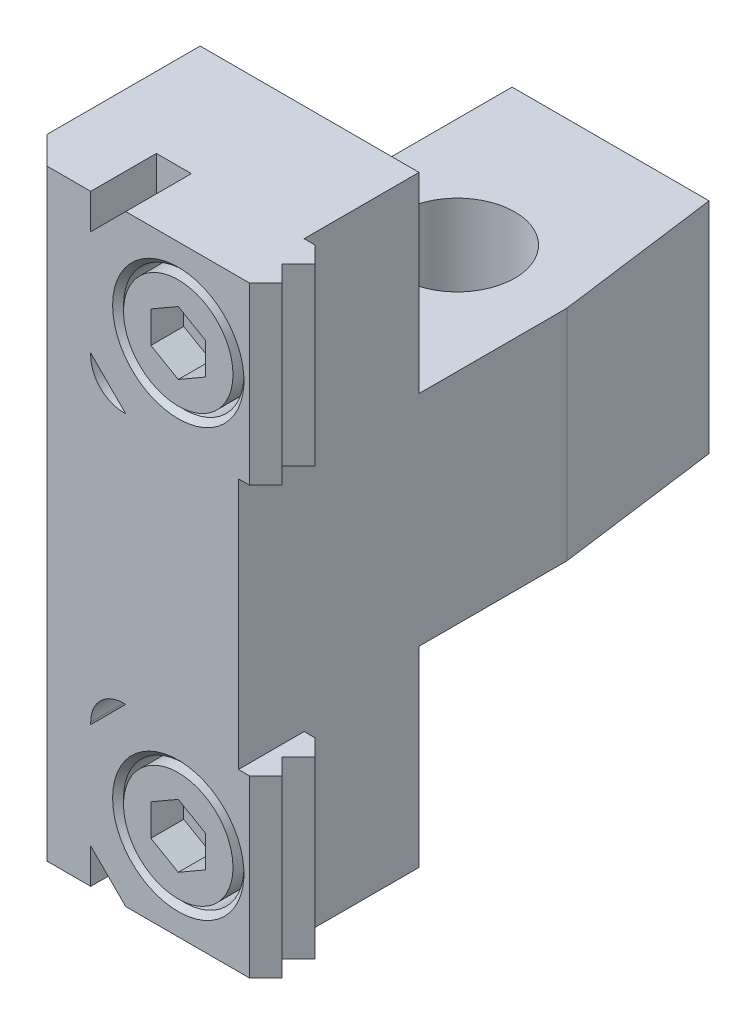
ISO-10303-21;
HEADER;
FILE_DESCRIPTION(('STEP AP214'),'2;1');
FILE_NAME('part.step','',(''),(''),'','','');
FILE_SCHEMA(('AUTOMOTIVE_DESIGN { 1 0 10303 214 1 1 1 1 }'));
ENDSEC;
DATA;
#1=APPLICATION_CONTEXT('core data for automotive mechanical design processes');
#2=APPLICATION_PROTOCOL_DEFINITION('international standard','automotive_design',2000,#1);
#3=PRODUCT_CONTEXT('',#1,'mechanical');
#4=PRODUCT('Part','Part','',(#3));
#5=PRODUCT_RELATED_PRODUCT_CATEGORY('part','',(#4));
#6=PRODUCT_DEFINITION_FORMATION('','',#4);
#7=PRODUCT_DEFINITION_CONTEXT('part definition',#1,'design');
#8=PRODUCT_DEFINITION('design','',#6,#7);
#9=PRODUCT_DEFINITION_SHAPE('','',#8);
#10=(LENGTH_UNIT() NAMED_UNIT(*) SI_UNIT(.MILLI.,.METRE.));
#11=(NAMED_UNIT(*) PLANE_ANGLE_UNIT() SI_UNIT($,.RADIAN.));
#12=(NAMED_UNIT(*) SI_UNIT($,.STERADIAN.) SOLID_ANGLE_UNIT());
#13=UNCERTAINTY_MEASURE_WITH_UNIT(LENGTH_MEASURE(1.E-05),#10,'distance_accuracy_value','');
#14=(GEOMETRIC_REPRESENTATION_CONTEXT(3) GLOBAL_UNCERTAINTY_ASSIGNED_CONTEXT((#13)) GLOBAL_UNIT_ASSIGNED_CONTEXT((#10,
#11,#12)) REPRESENTATION_CONTEXT('',''));
#15=CARTESIAN_POINT('',(0.,0.,0.));
#16=DIRECTION('',(0.,0.,1.));
#17=DIRECTION('',(1.,0.,0.));
#18=AXIS2_PLACEMENT_3D('',#15,#16,#17);
#19=CARTESIAN_POINT('',(4.49999999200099,19.500000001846,32.));
#20=DIRECTION('',(0.,0.,1.));
#21=DIRECTION('',(1.,0.,0.));
#22=AXIS2_PLACEMENT_3D('',#19,#20,#21);
#23=CYLINDRICAL_SURFACE('',#22,5.);
#24=CARTESIAN_POINT('',(4.49999999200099,19.5000000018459,30.));
#25=DIRECTION('',(0.,0.,1.));
#26=DIRECTION('',(1.,0.,0.));
#27=AXIS2_PLACEMENT_3D('',#24,#25,#26);
#28=CIRCLE('',#27,5.);
#29=CARTESIAN_POINT('',(9.49999999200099,19.5000000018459,30.));
#30=VERTEX_POINT('',#29);
#31=EDGE_CURVE('E679',#30,#30,#28,.T.);
#32=ORIENTED_EDGE('',*,*,#31,.F.);
#33=EDGE_LOOP('',(#32));
#34=FACE_BOUND('',#33,.T.);
#35=CARTESIAN_POINT('',(4.49999999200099,19.5000000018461,26.));
#36=DIRECTION('',(0.,0.,-1.));
#37=DIRECTION('',(-1.,0.,0.));
#38=AXIS2_PLACEMENT_3D('',#35,#36,#37);
#39=CIRCLE('',#38,5.);
#40=CARTESIAN_POINT('',(-0.500000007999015,19.5000000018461,26.));
#41=VERTEX_POINT('',#40);
#42=EDGE_CURVE('E1536',#41,#41,#39,.T.);
#43=ORIENTED_EDGE('',*,*,#42,.F.);
#44=EDGE_LOOP('',(#43));
#45=FACE_BOUND('',#44,.T.);
#46=ADVANCED_FACE('F15',(#34,#45),#23,.T.);
#47=CARTESIAN_POINT('',(4.49999999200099,22.3867513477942,27.));
#48=DIRECTION('',(-0.5,-0.866025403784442,0.));
#49=DIRECTION('',(0.86602540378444,-0.5,0.));
#50=AXIS2_PLACEMENT_3D('',#47,#48,#49);
#51=PLANE('',#50);
#52=DIRECTION('',(0.,0.,1.));
#53=VECTOR('',#52,1.);
#54=CARTESIAN_POINT('',(6.99999999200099,20.9433756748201,27.));
#55=LINE('',#54,#53);
#56=CARTESIAN_POINT('',(6.99999999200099,20.9433756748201,27.));
#57=VERTEX_POINT('',#56);
#58=CARTESIAN_POINT('',(6.99999999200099,20.9433756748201,30.));
#59=VERTEX_POINT('',#58);
#60=EDGE_CURVE('E1590',#57,#59,#55,.T.);
#61=ORIENTED_EDGE('',*,*,#60,.T.);
#62=DIRECTION('',(0.86602540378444,-0.5,0.));
#63=VECTOR('',#62,1.);
#64=CARTESIAN_POINT('',(4.49999999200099,22.386751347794,30.));
#65=LINE('',#64,#63);
#66=CARTESIAN_POINT('',(4.49999999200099,22.386751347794,30.));
#67=VERTEX_POINT('',#66);
#68=EDGE_CURVE('E35',#67,#59,#65,.T.);
#69=ORIENTED_EDGE('',*,*,#68,.F.);
#70=DIRECTION('',(0.,0.,1.));
#71=VECTOR('',#70,1.);
#72=CARTESIAN_POINT('',(4.49999999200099,22.3867513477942,27.));
#73=LINE('',#72,#71);
#74=CARTESIAN_POINT('',(4.49999999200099,22.3867513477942,27.));
#75=VERTEX_POINT('',#74);
#76=EDGE_CURVE('E1562',#75,#67,#73,.T.);
#77=ORIENTED_EDGE('',*,*,#76,.F.);
#78=DIRECTION('',(0.86602540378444,-0.5,0.));
#79=VECTOR('',#78,1.);
#80=CARTESIAN_POINT('',(4.49999999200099,22.3867513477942,27.));
#81=LINE('',#80,#79);
#82=EDGE_CURVE('E1545',#75,#57,#81,.T.);
#83=ORIENTED_EDGE('',*,*,#82,.T.);
#84=EDGE_LOOP('',(#61,#69,#77,#83));
#85=FACE_BOUND('',#84,.T.);
#86=ADVANCED_FACE('F1461',(#85),#51,.T.);
#87=CARTESIAN_POINT('',(6.99999999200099,18.0566243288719,27.));
#88=DIRECTION('',(1.,0.,0.));
#89=DIRECTION('',(0.,1.,0.));
#90=AXIS2_PLACEMENT_3D('',#87,#88,#89);
#91=PLANE('',#90);
#92=DIRECTION('',(0.,0.,1.));
#93=VECTOR('',#92,1.);
#94=CARTESIAN_POINT('',(6.99999999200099,18.0566243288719,27.));
#95=LINE('',#94,#93);
#96=CARTESIAN_POINT('',(6.99999999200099,18.0566243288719,27.));
#97=VERTEX_POINT('',#96);
#98=CARTESIAN_POINT('',(6.99999999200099,18.056624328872,30.));
#99=VERTEX_POINT('',#98);
#100=EDGE_CURVE('E1587',#97,#99,#95,.T.);
#101=ORIENTED_EDGE('',*,*,#100,.T.);
#102=DIRECTION('',(0.,1.,0.));
#103=VECTOR('',#102,1.);
#104=CARTESIAN_POINT('',(6.99999999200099,18.056624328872,30.));
#105=LINE('',#104,#103);
#106=EDGE_CURVE('E1555',#99,#59,#105,.T.);
#107=ORIENTED_EDGE('',*,*,#106,.T.);
#108=ORIENTED_EDGE('',*,*,#60,.F.);
#109=DIRECTION('',(0.,1.,0.));
#110=VECTOR('',#109,1.);
#111=CARTESIAN_POINT('',(6.99999999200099,18.0566243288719,27.));
#112=LINE('',#111,#110);
#113=EDGE_CURVE('E1572',#97,#57,#112,.T.);
#114=ORIENTED_EDGE('',*,*,#113,.F.);
#115=EDGE_LOOP('',(#101,#107,#108,#114));
#116=FACE_BOUND('',#115,.T.);
#117=ADVANCED_FACE('F1451',(#116),#91,.F.);
#118=CARTESIAN_POINT('',(4.49999999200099,16.6132486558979,27.));
#119=DIRECTION('',(0.5,-0.866025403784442,0.));
#120=DIRECTION('',(0.86602540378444,0.5,0.));
#121=AXIS2_PLACEMENT_3D('',#118,#119,#120);
#122=PLANE('',#121);
#123=DIRECTION('',(0.,0.,1.));
#124=VECTOR('',#123,1.);
#125=CARTESIAN_POINT('',(4.49999999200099,16.6132486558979,27.));
#126=LINE('',#125,#124);
#127=CARTESIAN_POINT('',(4.49999999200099,16.6132486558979,27.));
#128=VERTEX_POINT('',#127);
#129=CARTESIAN_POINT('',(4.49999999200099,16.6132486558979,30.));
#130=VERTEX_POINT('',#129);
#131=EDGE_CURVE('E1584',#128,#130,#126,.T.);
#132=ORIENTED_EDGE('',*,*,#131,.T.);
#133=DIRECTION('',(0.86602540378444,0.5,0.));
#134=VECTOR('',#133,1.);
#135=CARTESIAN_POINT('',(4.49999999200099,16.6132486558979,30.));
#136=LINE('',#135,#134);
#137=EDGE_CURVE('E1552',#130,#99,#136,.T.);
#138=ORIENTED_EDGE('',*,*,#137,.T.);
#139=ORIENTED_EDGE('',*,*,#100,.F.);
#140=DIRECTION('',(0.86602540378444,0.5,0.));
#141=VECTOR('',#140,1.);
#142=CARTESIAN_POINT('',(4.49999999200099,16.6132486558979,27.));
#143=LINE('',#142,#141);
#144=EDGE_CURVE('E1569',#128,#97,#143,.T.);
#145=ORIENTED_EDGE('',*,*,#144,.F.);
#146=EDGE_LOOP('',(#132,#138,#139,#145));
#147=FACE_BOUND('',#146,.T.);
#148=ADVANCED_FACE('F1441',(#147),#122,.F.);
#149=CARTESIAN_POINT('',(4.49999999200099,16.6132486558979,27.));
#150=DIRECTION('',(0.5,0.866025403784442,0.));
#151=DIRECTION('',(-0.86602540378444,0.5,0.));
#152=AXIS2_PLACEMENT_3D('',#149,#150,#151);
#153=PLANE('',#152);
#154=DIRECTION('',(0.,0.,1.));
#155=VECTOR('',#154,1.);
#156=CARTESIAN_POINT('',(1.99999999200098,18.0566243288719,27.));
#157=LINE('',#156,#155);
#158=CARTESIAN_POINT('',(1.99999999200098,18.0566243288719,27.));
#159=VERTEX_POINT('',#158);
#160=CARTESIAN_POINT('',(1.99999999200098,18.0566243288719,30.));
#161=VERTEX_POINT('',#160);
#162=EDGE_CURVE('E1581',#159,#161,#157,.T.);
#163=ORIENTED_EDGE('',*,*,#162,.T.);
#164=DIRECTION('',(-0.86602540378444,0.5,0.));
#165=VECTOR('',#164,1.);
#166=CARTESIAN_POINT('',(4.49999999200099,16.6132486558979,30.));
#167=LINE('',#166,#165);
#168=EDGE_CURVE('E1549',#130,#161,#167,.T.);
#169=ORIENTED_EDGE('',*,*,#168,.F.);
#170=ORIENTED_EDGE('',*,*,#131,.F.);
#171=DIRECTION('',(-0.86602540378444,0.5,0.));
#172=VECTOR('',#171,1.);
#173=CARTESIAN_POINT('',(4.49999999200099,16.6132486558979,27.));
#174=LINE('',#173,#172);
#175=EDGE_CURVE('E1566',#128,#159,#174,.T.);
#176=ORIENTED_EDGE('',*,*,#175,.T.);
#177=EDGE_LOOP('',(#163,#169,#170,#176));
#178=FACE_BOUND('',#177,.T.);
#179=ADVANCED_FACE('F1431',(#178),#153,.T.);
#180=CARTESIAN_POINT('',(1.99999999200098,20.9433756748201,27.));
#181=DIRECTION('',(-1.,0.,0.));
#182=DIRECTION('',(0.,-1.,0.));
#183=AXIS2_PLACEMENT_3D('',#180,#181,#182);
#184=PLANE('',#183);
#185=DIRECTION('',(0.,0.,1.));
#186=VECTOR('',#185,1.);
#187=CARTESIAN_POINT('',(1.99999999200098,20.9433756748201,27.));
#188=LINE('',#187,#186);
#189=CARTESIAN_POINT('',(1.99999999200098,20.9433756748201,27.));
#190=VERTEX_POINT('',#189);
#191=CARTESIAN_POINT('',(1.99999999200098,20.9433756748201,30.));
#192=VERTEX_POINT('',#191);
#193=EDGE_CURVE('E1578',#190,#192,#188,.T.);
#194=ORIENTED_EDGE('',*,*,#193,.T.);
#195=DIRECTION('',(0.,-1.,0.));
#196=VECTOR('',#195,1.);
#197=CARTESIAN_POINT('',(1.99999999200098,20.9433756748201,30.));
#198=LINE('',#197,#196);
#199=EDGE_CURVE('E1546',#192,#161,#198,.T.);
#200=ORIENTED_EDGE('',*,*,#199,.T.);
#201=ORIENTED_EDGE('',*,*,#162,.F.);
#202=DIRECTION('',(0.,-1.,0.));
#203=VECTOR('',#202,1.);
#204=CARTESIAN_POINT('',(1.99999999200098,20.9433756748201,27.));
#205=LINE('',#204,#203);
#206=EDGE_CURVE('E1563',#190,#159,#205,.T.);
#207=ORIENTED_EDGE('',*,*,#206,.F.);
#208=EDGE_LOOP('',(#194,#200,#201,#207));
#209=FACE_BOUND('',#208,.T.);
#210=ADVANCED_FACE('F1414',(#209),#184,.F.);
#211=CARTESIAN_POINT('',(4.49999999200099,22.3867513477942,27.));
#212=DIRECTION('',(-0.5,0.866025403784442,0.));
#213=DIRECTION('',(-0.86602540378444,-0.5,0.));
#214=AXIS2_PLACEMENT_3D('',#211,#212,#213);
#215=PLANE('',#214);
#216=DIRECTION('',(-0.86602540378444,-0.5,0.));
#217=VECTOR('',#216,1.);
#218=CARTESIAN_POINT('',(4.49999999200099,22.3867513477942,27.));
#219=LINE('',#218,#217);
#220=EDGE_CURVE('E1559',#75,#190,#219,.T.);
#221=ORIENTED_EDGE('',*,*,#220,.F.);
#222=ORIENTED_EDGE('',*,*,#76,.T.);
#223=DIRECTION('',(-0.86602540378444,-0.5,0.));
#224=VECTOR('',#223,1.);
#225=CARTESIAN_POINT('',(4.49999999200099,22.386751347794,30.));
#226=LINE('',#225,#224);
#227=EDGE_CURVE('E1542',#67,#192,#226,.T.);
#228=ORIENTED_EDGE('',*,*,#227,.T.);
#229=ORIENTED_EDGE('',*,*,#193,.F.);
#230=EDGE_LOOP('',(#221,#222,#228,#229));
#231=FACE_BOUND('',#230,.T.);
#232=ADVANCED_FACE('F797',(#231),#215,.F.);
#233=CARTESIAN_POINT('',(6.99999999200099,20.9433756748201,27.));
#234=DIRECTION('',(0.,0.,1.));
#235=DIRECTION('',(1.,0.,0.));
#236=AXIS2_PLACEMENT_3D('',#233,#234,#235);
#237=PLANE('',#236);
#238=ORIENTED_EDGE('',*,*,#82,.F.);
#239=ORIENTED_EDGE('',*,*,#220,.T.);
#240=ORIENTED_EDGE('',*,*,#206,.T.);
#241=ORIENTED_EDGE('',*,*,#175,.F.);
#242=ORIENTED_EDGE('',*,*,#144,.T.);
#243=ORIENTED_EDGE('',*,*,#113,.T.);
#244=EDGE_LOOP('',(#238,#239,#240,#241,#242,#243));
#245=FACE_BOUND('',#244,.T.);
#246=ADVANCED_FACE('F794',(#245),#237,.T.);
#247=CARTESIAN_POINT('',(4.49999999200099,19.5000000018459,30.));
#248=DIRECTION('',(0.,0.,1.));
#249=DIRECTION('',(1.,0.,0.));
#250=AXIS2_PLACEMENT_3D('',#247,#248,#249);
#251=PLANE('',#250);
#252=ORIENTED_EDGE('',*,*,#31,.T.);
#253=EDGE_LOOP('',(#252));
#254=FACE_BOUND('',#253,.T.);
#255=ORIENTED_EDGE('',*,*,#227,.F.);
#256=ORIENTED_EDGE('',*,*,#68,.T.);
#257=ORIENTED_EDGE('',*,*,#106,.F.);
#258=ORIENTED_EDGE('',*,*,#137,.F.);
#259=ORIENTED_EDGE('',*,*,#168,.T.);
#260=ORIENTED_EDGE('',*,*,#199,.F.);
#261=EDGE_LOOP('',(#255,#256,#257,#258,#259,#260));
#262=FACE_BOUND('',#261,.T.);
#263=ADVANCED_FACE('F781',(#254,#262),#251,.T.);
#264=CARTESIAN_POINT('',(4.49999999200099,19.5000000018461,16.));
#265=DIRECTION('',(0.,0.,-1.));
#266=DIRECTION('',(-1.,0.,0.));
#267=AXIS2_PLACEMENT_3D('',#264,#265,#266);
#268=PLANE('',#267);
#269=CARTESIAN_POINT('',(4.49999999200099,19.5000000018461,16.));
#270=DIRECTION('',(0.,0.,-1.));
#271=DIRECTION('',(-1.,0.,0.));
#272=AXIS2_PLACEMENT_3D('',#269,#270,#271);
#273=CIRCLE('',#272,3.);
#274=CARTESIAN_POINT('',(1.49999999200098,19.5000000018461,16.));
#275=VERTEX_POINT('',#274);
#276=EDGE_CURVE('E426',#275,#275,#273,.T.);
#277=ORIENTED_EDGE('',*,*,#276,.T.);
#278=EDGE_LOOP('',(#277));
#279=FACE_BOUND('',#278,.T.);
#280=ADVANCED_FACE('F778',(#279),#268,.T.);
#281=CARTESIAN_POINT('',(7.00000000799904,-18.0566243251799,27.));
#282=DIRECTION('',(0.,0.,1.));
#283=DIRECTION('',(1.,0.,0.));
#284=AXIS2_PLACEMENT_3D('',#281,#282,#283);
#285=PLANE('',#284);
#286=DIRECTION('',(0.86602540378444,-0.5,0.));
#287=VECTOR('',#286,1.);
#288=CARTESIAN_POINT('',(4.50000000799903,-16.6132486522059,27.));
#289=LINE('',#288,#287);
#290=CARTESIAN_POINT('',(4.50000000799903,-16.6132486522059,27.));
#291=VERTEX_POINT('',#290);
#292=CARTESIAN_POINT('',(7.00000000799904,-18.0566243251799,27.));
#293=VERTEX_POINT('',#292);
#294=EDGE_CURVE('E624',#291,#293,#289,.T.);
#295=ORIENTED_EDGE('',*,*,#294,.F.);
#296=DIRECTION('',(-0.86602540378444,-0.5,0.));
#297=VECTOR('',#296,1.);
#298=CARTESIAN_POINT('',(4.50000000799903,-16.6132486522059,27.));
#299=LINE('',#298,#297);
#300=CARTESIAN_POINT('',(2.00000000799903,-18.0566243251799,27.));
#301=VERTEX_POINT('',#300);
#302=EDGE_CURVE('E639',#291,#301,#299,.T.);
#303=ORIENTED_EDGE('',*,*,#302,.T.);
#304=DIRECTION('',(0.,-1.,0.));
#305=VECTOR('',#304,1.);
#306=CARTESIAN_POINT('',(2.00000000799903,-18.0566243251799,27.));
#307=LINE('',#306,#305);
#308=CARTESIAN_POINT('',(2.00000000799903,-20.943375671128,27.));
#309=VERTEX_POINT('',#308);
#310=EDGE_CURVE('E643',#301,#309,#307,.T.);
#311=ORIENTED_EDGE('',*,*,#310,.T.);
#312=DIRECTION('',(-0.86602540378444,0.5,0.));
#313=VECTOR('',#312,1.);
#314=CARTESIAN_POINT('',(4.50000000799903,-22.3867513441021,27.));
#315=LINE('',#314,#313);
#316=CARTESIAN_POINT('',(4.50000000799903,-22.3867513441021,27.));
#317=VERTEX_POINT('',#316);
#318=EDGE_CURVE('E646',#317,#309,#315,.T.);
#319=ORIENTED_EDGE('',*,*,#318,.F.);
#320=DIRECTION('',(0.86602540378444,0.5,0.));
#321=VECTOR('',#320,1.);
#322=CARTESIAN_POINT('',(4.50000000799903,-22.3867513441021,27.));
#323=LINE('',#322,#321);
#324=CARTESIAN_POINT('',(7.00000000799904,-20.943375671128,27.));
#325=VERTEX_POINT('',#324);
#326=EDGE_CURVE('E649',#317,#325,#323,.T.);
#327=ORIENTED_EDGE('',*,*,#326,.T.);
#328=DIRECTION('',(0.,1.,0.));
#329=VECTOR('',#328,1.);
#330=CARTESIAN_POINT('',(7.00000000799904,-20.943375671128,27.));
#331=LINE('',#330,#329);
#332=EDGE_CURVE('E652',#325,#293,#331,.T.);
#333=ORIENTED_EDGE('',*,*,#332,.T.);
#334=EDGE_LOOP('',(#295,#303,#311,#319,#327,#333));
#335=FACE_BOUND('',#334,.T.);
#336=ADVANCED_FACE('F780',(#335),#285,.T.);
#337=CARTESIAN_POINT('',(2.00000000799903,-18.0566243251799,27.));
#338=DIRECTION('',(-1.,0.,0.));
#339=DIRECTION('',(0.,-1.,0.));
#340=AXIS2_PLACEMENT_3D('',#337,#338,#339);
#341=PLANE('',#340);
#342=DIRECTION('',(0.,0.,1.));
#343=VECTOR('',#342,1.);
#344=CARTESIAN_POINT('',(2.00000000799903,-18.0566243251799,27.));
#345=LINE('',#344,#343);
#346=CARTESIAN_POINT('',(2.00000000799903,-18.0566243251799,30.));
#347=VERTEX_POINT('',#346);
#348=EDGE_CURVE('E659',#301,#347,#345,.T.);
#349=ORIENTED_EDGE('',*,*,#348,.T.);
#350=DIRECTION('',(0.,-1.,0.));
#351=VECTOR('',#350,1.);
#352=CARTESIAN_POINT('',(2.00000000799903,-18.0566243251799,30.));
#353=LINE('',#352,#351);
#354=CARTESIAN_POINT('',(2.00000000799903,-20.943375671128,30.));
#355=VERTEX_POINT('',#354);
#356=EDGE_CURVE('E625',#347,#355,#353,.T.);
#357=ORIENTED_EDGE('',*,*,#356,.T.);
#358=DIRECTION('',(0.,0.,1.));
#359=VECTOR('',#358,1.);
#360=CARTESIAN_POINT('',(2.00000000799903,-20.943375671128,27.));
#361=LINE('',#360,#359);
#362=EDGE_CURVE('E661',#309,#355,#361,.T.);
#363=ORIENTED_EDGE('',*,*,#362,.F.);
#364=ORIENTED_EDGE('',*,*,#310,.F.);
#365=EDGE_LOOP('',(#349,#357,#363,#364));
#366=FACE_BOUND('',#365,.T.);
#367=ADVANCED_FACE('F790',(#366),#341,.F.);
#368=CARTESIAN_POINT('',(4.50000000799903,-22.3867513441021,27.));
#369=DIRECTION('',(0.5,0.866025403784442,0.));
#370=DIRECTION('',(-0.86602540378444,0.5,0.));
#371=AXIS2_PLACEMENT_3D('',#368,#369,#370);
#372=PLANE('',#371);
#373=ORIENTED_EDGE('',*,*,#362,.T.);
#374=DIRECTION('',(-0.86602540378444,0.5,0.));
#375=VECTOR('',#374,1.);
#376=CARTESIAN_POINT('',(4.50000000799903,-22.3867513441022,30.));
#377=LINE('',#376,#375);
#378=CARTESIAN_POINT('',(4.50000000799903,-22.3867513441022,30.));
#379=VERTEX_POINT('',#378);
#380=EDGE_CURVE('E628',#379,#355,#377,.T.);
#381=ORIENTED_EDGE('',*,*,#380,.F.);
#382=DIRECTION('',(0.,0.,1.));
#383=VECTOR('',#382,1.);
#384=CARTESIAN_POINT('',(4.50000000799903,-22.3867513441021,27.));
#385=LINE('',#384,#383);
#386=EDGE_CURVE('E663',#317,#379,#385,.T.);
#387=ORIENTED_EDGE('',*,*,#386,.F.);
#388=ORIENTED_EDGE('',*,*,#318,.T.);
#389=EDGE_LOOP('',(#373,#381,#387,#388));
#390=FACE_BOUND('',#389,.T.);
#391=ADVANCED_FACE('F1388',(#390),#372,.T.);
#392=CARTESIAN_POINT('',(4.50000000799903,-22.3867513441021,27.));
#393=DIRECTION('',(0.5,-0.866025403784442,0.));
#394=DIRECTION('',(0.86602540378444,0.5,0.));
#395=AXIS2_PLACEMENT_3D('',#392,#393,#394);
#396=PLANE('',#395);
#397=ORIENTED_EDGE('',*,*,#386,.T.);
#398=DIRECTION('',(0.86602540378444,0.5,0.));
#399=VECTOR('',#398,1.);
#400=CARTESIAN_POINT('',(4.50000000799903,-22.3867513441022,30.));
#401=LINE('',#400,#399);
#402=CARTESIAN_POINT('',(7.00000000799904,-20.943375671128,30.));
#403=VERTEX_POINT('',#402);
#404=EDGE_CURVE('E631',#379,#403,#401,.T.);
#405=ORIENTED_EDGE('',*,*,#404,.T.);
#406=DIRECTION('',(0.,0.,1.));
#407=VECTOR('',#406,1.);
#408=CARTESIAN_POINT('',(7.00000000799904,-20.943375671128,27.));
#409=LINE('',#408,#407);
#410=EDGE_CURVE('E665',#325,#403,#409,.T.);
#411=ORIENTED_EDGE('',*,*,#410,.F.);
#412=ORIENTED_EDGE('',*,*,#326,.F.);
#413=EDGE_LOOP('',(#397,#405,#411,#412));
#414=FACE_BOUND('',#413,.T.);
#415=ADVANCED_FACE('F1378',(#414),#396,.F.);
#416=CARTESIAN_POINT('',(7.00000000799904,-20.943375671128,27.));
#417=DIRECTION('',(1.,0.,0.));
#418=DIRECTION('',(0.,1.,0.));
#419=AXIS2_PLACEMENT_3D('',#416,#417,#418);
#420=PLANE('',#419);
#421=ORIENTED_EDGE('',*,*,#410,.T.);
#422=DIRECTION('',(0.,1.,0.));
#423=VECTOR('',#422,1.);
#424=CARTESIAN_POINT('',(7.00000000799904,-20.943375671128,30.));
#425=LINE('',#424,#423);
#426=CARTESIAN_POINT('',(7.00000000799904,-18.0566243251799,30.));
#427=VERTEX_POINT('',#426);
#428=EDGE_CURVE('E634',#403,#427,#425,.T.);
#429=ORIENTED_EDGE('',*,*,#428,.T.);
#430=DIRECTION('',(0.,0.,1.));
#431=VECTOR('',#430,1.);
#432=CARTESIAN_POINT('',(7.00000000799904,-18.0566243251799,27.));
#433=LINE('',#432,#431);
#434=EDGE_CURVE('E667',#293,#427,#433,.T.);
#435=ORIENTED_EDGE('',*,*,#434,.F.);
#436=ORIENTED_EDGE('',*,*,#332,.F.);
#437=EDGE_LOOP('',(#421,#429,#435,#436));
#438=FACE_BOUND('',#437,.T.);
#439=ADVANCED_FACE('F1368',(#438),#420,.F.);
#440=CARTESIAN_POINT('',(4.50000000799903,-16.6132486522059,27.));
#441=DIRECTION('',(-0.5,-0.866025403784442,0.));
#442=DIRECTION('',(0.86602540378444,-0.5,0.));
#443=AXIS2_PLACEMENT_3D('',#440,#441,#442);
#444=PLANE('',#443);
#445=ORIENTED_EDGE('',*,*,#434,.T.);
#446=DIRECTION('',(0.86602540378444,-0.5,0.));
#447=VECTOR('',#446,1.);
#448=CARTESIAN_POINT('',(4.50000000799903,-16.613248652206,30.));
#449=LINE('',#448,#447);
#450=CARTESIAN_POINT('',(4.50000000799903,-16.613248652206,30.));
#451=VERTEX_POINT('',#450);
#452=EDGE_CURVE('E620',#451,#427,#449,.T.);
#453=ORIENTED_EDGE('',*,*,#452,.F.);
#454=DIRECTION('',(0.,0.,1.));
#455=VECTOR('',#454,1.);
#456=CARTESIAN_POINT('',(4.50000000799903,-16.6132486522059,27.));
#457=LINE('',#456,#455);
#458=EDGE_CURVE('E642',#291,#451,#457,.T.);
#459=ORIENTED_EDGE('',*,*,#458,.F.);
#460=ORIENTED_EDGE('',*,*,#294,.T.);
#461=EDGE_LOOP('',(#445,#453,#459,#460));
#462=FACE_BOUND('',#461,.T.);
#463=ADVANCED_FACE('F811',(#462),#444,.T.);
#464=CARTESIAN_POINT('',(4.50000000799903,-16.6132486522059,27.));
#465=DIRECTION('',(-0.5,0.866025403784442,0.));
#466=DIRECTION('',(-0.86602540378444,-0.5,0.));
#467=AXIS2_PLACEMENT_3D('',#464,#465,#466);
#468=PLANE('',#467);
#469=ORIENTED_EDGE('',*,*,#302,.F.);
#470=ORIENTED_EDGE('',*,*,#458,.T.);
#471=DIRECTION('',(-0.86602540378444,-0.5,0.));
#472=VECTOR('',#471,1.);
#473=CARTESIAN_POINT('',(4.50000000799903,-16.613248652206,30.));
#474=LINE('',#473,#472);
#475=EDGE_CURVE('E621',#451,#347,#474,.T.);
#476=ORIENTED_EDGE('',*,*,#475,.T.);
#477=ORIENTED_EDGE('',*,*,#348,.F.);
#478=EDGE_LOOP('',(#469,#470,#476,#477));
#479=FACE_BOUND('',#478,.T.);
#480=ADVANCED_FACE('F793',(#479),#468,.F.);
#481=CARTESIAN_POINT('',(4.50000000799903,-19.4999999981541,30.));
#482=DIRECTION('',(0.,0.,1.));
#483=DIRECTION('',(1.,0.,0.));
#484=AXIS2_PLACEMENT_3D('',#481,#482,#483);
#485=PLANE('',#484);
#486=CARTESIAN_POINT('',(4.50000000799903,-19.4999999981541,30.));
#487=DIRECTION('',(0.,0.,1.));
#488=DIRECTION('',(1.,0.,0.));
#489=AXIS2_PLACEMENT_3D('',#486,#487,#488);
#490=CIRCLE('',#489,5.);
#491=CARTESIAN_POINT('',(9.50000000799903,-19.4999999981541,30.));
#492=VERTEX_POINT('',#491);
#493=EDGE_CURVE('E336',#492,#492,#490,.T.);
#494=ORIENTED_EDGE('',*,*,#493,.T.);
#495=EDGE_LOOP('',(#494));
#496=FACE_BOUND('',#495,.T.);
#497=ORIENTED_EDGE('',*,*,#475,.F.);
#498=ORIENTED_EDGE('',*,*,#452,.T.);
#499=ORIENTED_EDGE('',*,*,#428,.F.);
#500=ORIENTED_EDGE('',*,*,#404,.F.);
#501=ORIENTED_EDGE('',*,*,#380,.T.);
#502=ORIENTED_EDGE('',*,*,#356,.F.);
#503=EDGE_LOOP('',(#497,#498,#499,#500,#501,#502));
#504=FACE_BOUND('',#503,.T.);
#505=ADVANCED_FACE('F784',(#496,#504),#485,.T.);
#506=CARTESIAN_POINT('',(4.50000000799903,-19.499999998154,32.));
#507=DIRECTION('',(0.,0.,1.));
#508=DIRECTION('',(1.,0.,0.));
#509=AXIS2_PLACEMENT_3D('',#506,#507,#508);
#510=CYLINDRICAL_SURFACE('',#509,5.);
#511=ORIENTED_EDGE('',*,*,#493,.F.);
#512=EDGE_LOOP('',(#511));
#513=FACE_BOUND('',#512,.T.);
#514=CARTESIAN_POINT('',(4.50000000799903,-19.499999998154,26.));
#515=DIRECTION('',(0.,0.,-1.));
#516=DIRECTION('',(-1.,0.,0.));
#517=AXIS2_PLACEMENT_3D('',#514,#515,#516);
#518=CIRCLE('',#517,5.);
#519=CARTESIAN_POINT('',(-0.49999999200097,-19.499999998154,26.));
#520=VERTEX_POINT('',#519);
#521=EDGE_CURVE('E614',#520,#520,#518,.T.);
#522=ORIENTED_EDGE('',*,*,#521,.F.);
#523=EDGE_LOOP('',(#522));
#524=FACE_BOUND('',#523,.T.);
#525=ADVANCED_FACE('F801',(#513,#524),#510,.T.);
#526=CARTESIAN_POINT('',(-0.999999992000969,-19.5000000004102,26.));
#527=DIRECTION('',(0.,0.,-1.));
#528=DIRECTION('',(1.,4.10206197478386E-10,0.));
#529=AXIS2_PLACEMENT_3D('',#526,#527,#528);
#530=PLANE('',#529);
#531=CARTESIAN_POINT('',(4.50000000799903,-19.4999999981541,26.));
#532=DIRECTION('',(0.,0.,1.));
#533=DIRECTION('',(-1.,-4.10206197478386E-10,0.));
#534=AXIS2_PLACEMENT_3D('',#531,#532,#533);
#535=CIRCLE('',#534,5.5);
#536=CARTESIAN_POINT('',(-0.99999999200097,-19.5000000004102,26.));
#537=VERTEX_POINT('',#536);
#538=EDGE_CURVE('E326',#537,#537,#535,.T.);
#539=ORIENTED_EDGE('',*,*,#538,.T.);
#540=EDGE_LOOP('',(#539));
#541=FACE_BOUND('',#540,.T.);
#542=ORIENTED_EDGE('',*,*,#521,.T.);
#543=EDGE_LOOP('',(#542));
#544=FACE_BOUND('',#543,.T.);
#545=ADVANCED_FACE('F757',(#541,#544),#530,.F.);
#546=CARTESIAN_POINT('',(4.50000000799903,-19.4999999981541,30.));
#547=DIRECTION('',(0.,0.,1.));
#548=DIRECTION('',(-1.,-4.10206197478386E-10,0.));
#549=AXIS2_PLACEMENT_3D('',#546,#547,#548);
#550=CYLINDRICAL_SURFACE('',#549,5.5);
#551=ORIENTED_EDGE('',*,*,#538,.F.);
#552=EDGE_LOOP('',(#551));
#553=FACE_BOUND('',#552,.T.);
#554=CARTESIAN_POINT('',(4.50000000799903,-19.4999999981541,29.4999998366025));
#555=DIRECTION('',(0.,0.,1.));
#556=DIRECTION('',(-1.,-4.10206197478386E-10,0.));
#557=AXIS2_PLACEMENT_3D('',#554,#555,#556);
#558=CIRCLE('',#557,5.5);
#559=CARTESIAN_POINT('',(-0.99999999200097,-19.5000000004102,29.4999998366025));
#560=VERTEX_POINT('',#559);
#561=EDGE_CURVE('E339',#560,#560,#558,.T.);
#562=ORIENTED_EDGE('',*,*,#561,.T.);
#563=EDGE_LOOP('',(#562));
#564=FACE_BOUND('',#563,.T.);
#565=ADVANCED_FACE('F877',(#553,#564),#550,.F.);
#566=CARTESIAN_POINT('',(4.50000000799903,-19.4999999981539,16.));
#567=DIRECTION('',(0.,0.,-1.));
#568=DIRECTION('',(-1.,0.,0.));
#569=AXIS2_PLACEMENT_3D('',#566,#567,#568);
#570=PLANE('',#569);
#571=CARTESIAN_POINT('',(4.50000000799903,-19.4999999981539,16.));
#572=DIRECTION('',(0.,0.,-1.));
#573=DIRECTION('',(-1.,0.,0.));
#574=AXIS2_PLACEMENT_3D('',#571,#572,#573);
#575=CIRCLE('',#574,3.);
#576=CARTESIAN_POINT('',(1.50000000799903,-19.4999999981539,16.));
#577=VERTEX_POINT('',#576);
#578=EDGE_CURVE('E607',#577,#577,#575,.T.);
#579=ORIENTED_EDGE('',*,*,#578,.T.);
#580=EDGE_LOOP('',(#579));
#581=FACE_BOUND('',#580,.T.);
#582=ADVANCED_FACE('F771',(#581),#570,.T.);
#583=CARTESIAN_POINT('',(9.99999998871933,27.5000000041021,24.));
#584=DIRECTION('',(0.,0.,1.));
#585=DIRECTION('',(-1.,-4.10206857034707E-10,0.));
#586=AXIS2_PLACEMENT_3D('',#583,#584,#585);
#587=PLANE('',#586);
#588=DIRECTION('',(0.707106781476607,-0.707106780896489,0.));
#589=VECTOR('',#588,1.);
#590=CARTESIAN_POINT('',(-0.300000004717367,11.4999999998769,24.));
#591=LINE('',#590,#589);
#592=CARTESIAN_POINT('',(-3.50000000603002,14.6999999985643,24.));
#593=VERTEX_POINT('',#592);
#594=CARTESIAN_POINT('',(-0.300000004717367,11.4999999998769,24.));
#595=VERTEX_POINT('',#594);
#596=EDGE_CURVE('E724',#593,#595,#591,.T.);
#597=ORIENTED_EDGE('',*,*,#596,.F.);
#598=DIRECTION('',(4.10207155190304E-10,-1.,0.));
#599=VECTOR('',#598,1.);
#600=CARTESIAN_POINT('',(-3.50000001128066,27.4999999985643,24.));
#601=LINE('',#600,#599);
#602=CARTESIAN_POINT('',(-3.50000000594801,14.4999999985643,24.));
#603=VERTEX_POINT('',#602);
#604=EDGE_CURVE('E441',#593,#603,#601,.T.);
#605=ORIENTED_EDGE('',*,*,#604,.T.);
#606=CARTESIAN_POINT('',(-0.500000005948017,14.4999999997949,24.));
#607=DIRECTION('',(0.,0.,1.));
#608=DIRECTION('',(-1.,-4.10206857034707E-10,0.));
#609=AXIS2_PLACEMENT_3D('',#606,#607,#608);
#610=CIRCLE('',#609,3.);
#611=CARTESIAN_POINT('',(-0.500000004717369,11.4999999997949,24.));
#612=VERTEX_POINT('',#611);
#613=EDGE_CURVE('E534',#603,#612,#610,.T.);
#614=ORIENTED_EDGE('',*,*,#613,.T.);
#615=DIRECTION('',(1.,4.10206857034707E-10,0.));
#616=VECTOR('',#615,1.);
#617=CARTESIAN_POINT('',(9.99999999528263,11.5000000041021,24.));
#618=LINE('',#617,#616);
#619=EDGE_CURVE('E445',#612,#595,#618,.T.);
#620=ORIENTED_EDGE('',*,*,#619,.T.);
#621=EDGE_LOOP('',(#597,#605,#614,#620));
#622=FACE_BOUND('',#621,.T.);
#623=ADVANCED_FACE('F747',(#622),#587,.T.);
#624=CARTESIAN_POINT('',(10.0000000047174,-11.4999999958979,24.));
#625=DIRECTION('',(0.,0.,1.));
#626=DIRECTION('',(-1.,-4.10206857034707E-10,0.));
#627=AXIS2_PLACEMENT_3D('',#624,#625,#626);
#628=PLANE('',#627);
#629=DIRECTION('',(-0.707106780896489,-0.707106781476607,0.));
#630=VECTOR('',#629,1.);
#631=CARTESIAN_POINT('',(-3.49999999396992,-14.7000000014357,24.));
#632=LINE('',#631,#630);
#633=CARTESIAN_POINT('',(-0.299999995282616,-11.5000000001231,24.));
#634=VERTEX_POINT('',#633);
#635=CARTESIAN_POINT('',(-3.49999999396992,-14.7000000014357,24.));
#636=VERTEX_POINT('',#635);
#637=EDGE_CURVE('E382',#634,#636,#632,.T.);
#638=ORIENTED_EDGE('',*,*,#637,.F.);
#639=DIRECTION('',(-1.,-4.10206857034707E-10,0.));
#640=VECTOR('',#639,1.);
#641=CARTESIAN_POINT('',(10.0000000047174,-11.4999999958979,24.));
#642=LINE('',#641,#640);
#643=CARTESIAN_POINT('',(-0.499999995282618,-11.5000000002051,24.));
#644=VERTEX_POINT('',#643);
#645=EDGE_CURVE('E456',#634,#644,#642,.T.);
#646=ORIENTED_EDGE('',*,*,#645,.T.);
#647=CARTESIAN_POINT('',(-0.499999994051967,-14.5000000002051,24.));
#648=DIRECTION('',(0.,0.,1.));
#649=DIRECTION('',(-1.,-4.10206857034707E-10,0.));
#650=AXIS2_PLACEMENT_3D('',#647,#648,#649);
#651=CIRCLE('',#650,3.);
#652=CARTESIAN_POINT('',(-3.49999999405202,-14.5000000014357,24.));
#653=VERTEX_POINT('',#652);
#654=EDGE_CURVE('E526',#644,#653,#651,.T.);
#655=ORIENTED_EDGE('',*,*,#654,.T.);
#656=DIRECTION('',(4.1020655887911E-10,-1.,0.));
#657=VECTOR('',#656,1.);
#658=CARTESIAN_POINT('',(-3.49999998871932,-27.5000000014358,24.));
#659=LINE('',#658,#657);
#660=EDGE_CURVE('E462',#653,#636,#659,.T.);
#661=ORIENTED_EDGE('',*,*,#660,.T.);
#662=EDGE_LOOP('',(#638,#646,#655,#661));
#663=FACE_BOUND('',#662,.T.);
#664=ADVANCED_FACE('F770',(#663),#628,.T.);
#665=CARTESIAN_POINT('',(-3.49999999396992,-14.7000000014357,30.));
#666=DIRECTION('',(0.707106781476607,-0.707106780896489,0.));
#667=DIRECTION('',(0.707106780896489,0.707106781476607,0.));
#668=AXIS2_PLACEMENT_3D('',#665,#666,#667);
#669=PLANE('',#668);
#670=ORIENTED_EDGE('',*,*,#637,.T.);
#671=DIRECTION('',(0.,0.,-1.));
#672=VECTOR('',#671,1.);
#673=CARTESIAN_POINT('',(-3.49999999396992,-14.7000000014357,30.));
#674=LINE('',#673,#672);
#675=CARTESIAN_POINT('',(-3.49999999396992,-14.7000000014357,30.));
#676=VERTEX_POINT('',#675);
#677=EDGE_CURVE('E405',#676,#636,#674,.T.);
#678=ORIENTED_EDGE('',*,*,#677,.F.);
#679=DIRECTION('',(-0.707106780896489,-0.707106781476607,0.));
#680=VECTOR('',#679,1.);
#681=CARTESIAN_POINT('',(-3.49999999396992,-14.7000000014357,30.));
#682=LINE('',#681,#680);
#683=CARTESIAN_POINT('',(-0.299999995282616,-11.5000000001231,30.));
#684=VERTEX_POINT('',#683);
#685=EDGE_CURVE('E392',#684,#676,#682,.T.);
#686=ORIENTED_EDGE('',*,*,#685,.F.);
#687=DIRECTION('',(0.,0.,-1.));
#688=VECTOR('',#687,1.);
#689=CARTESIAN_POINT('',(-0.299999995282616,-11.5000000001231,30.));
#690=LINE('',#689,#688);
#691=EDGE_CURVE('E407',#684,#634,#690,.T.);
#692=ORIENTED_EDGE('',*,*,#691,.T.);
#693=EDGE_LOOP('',(#670,#678,#686,#692));
#694=FACE_BOUND('',#693,.T.);
#695=ADVANCED_FACE('F835',(#694),#669,.F.);
#696=CARTESIAN_POINT('',(4.50000000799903,-19.4999999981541,30.));
#697=DIRECTION('',(0.,0.,1.));
#698=DIRECTION('',(-1.,-4.10206197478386E-10,0.));
#699=AXIS2_PLACEMENT_3D('',#696,#697,#698);
#700=CONICAL_SURFACE('',#699,6.,0.785398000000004);
#701=ORIENTED_EDGE('',*,*,#561,.F.);
#702=EDGE_LOOP('',(#701));
#703=FACE_BOUND('',#702,.T.);
#704=CARTESIAN_POINT('',(4.50000000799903,-19.4999999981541,30.));
#705=DIRECTION('',(0.,0.,1.));
#706=DIRECTION('',(-1.,-4.10206197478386E-10,0.));
#707=AXIS2_PLACEMENT_3D('',#704,#705,#706);
#708=CIRCLE('',#707,6.);
#709=CARTESIAN_POINT('',(-1.49999999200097,-19.5000000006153,30.));
#710=VERTEX_POINT('',#709);
#711=EDGE_CURVE('E342',#710,#710,#708,.T.);
#712=ORIENTED_EDGE('',*,*,#711,.T.);
#713=EDGE_LOOP('',(#712));
#714=FACE_BOUND('',#713,.T.);
#715=ADVANCED_FACE('F882',(#703,#714),#700,.F.);
#716=CARTESIAN_POINT('',(-0.299999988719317,-27.5000000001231,30.));
#717=DIRECTION('',(0.707106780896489,0.707106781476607,0.));
#718=DIRECTION('',(-0.707106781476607,0.707106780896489,0.));
#719=AXIS2_PLACEMENT_3D('',#716,#717,#718);
#720=PLANE('',#719);
#721=DIRECTION('',(0.707106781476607,-0.707106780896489,0.));
#722=VECTOR('',#721,1.);
#723=CARTESIAN_POINT('',(-0.299999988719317,-27.5000000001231,24.));
#724=LINE('',#723,#722);
#725=CARTESIAN_POINT('',(-3.49999999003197,-24.3000000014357,24.));
#726=VERTEX_POINT('',#725);
#727=CARTESIAN_POINT('',(-0.299999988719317,-27.5000000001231,24.));
#728=VERTEX_POINT('',#727);
#729=EDGE_CURVE('E385',#726,#728,#724,.T.);
#730=ORIENTED_EDGE('',*,*,#729,.T.);
#731=DIRECTION('',(0.,0.,-1.));
#732=VECTOR('',#731,1.);
#733=CARTESIAN_POINT('',(-0.299999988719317,-27.5000000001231,30.));
#734=LINE('',#733,#732);
#735=CARTESIAN_POINT('',(-0.299999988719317,-27.5000000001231,30.));
#736=VERTEX_POINT('',#735);
#737=EDGE_CURVE('E400',#736,#728,#734,.T.);
#738=ORIENTED_EDGE('',*,*,#737,.F.);
#739=DIRECTION('',(0.707106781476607,-0.707106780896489,0.));
#740=VECTOR('',#739,1.);
#741=CARTESIAN_POINT('',(-0.299999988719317,-27.5000000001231,30.));
#742=LINE('',#741,#740);
#743=CARTESIAN_POINT('',(-3.49999999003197,-24.3000000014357,30.));
#744=VERTEX_POINT('',#743);
#745=EDGE_CURVE('E395',#744,#736,#742,.T.);
#746=ORIENTED_EDGE('',*,*,#745,.F.);
#747=DIRECTION('',(0.,0.,-1.));
#748=VECTOR('',#747,1.);
#749=CARTESIAN_POINT('',(-3.49999999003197,-24.3000000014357,30.));
#750=LINE('',#749,#748);
#751=EDGE_CURVE('E403',#744,#726,#750,.T.);
#752=ORIENTED_EDGE('',*,*,#751,.T.);
#753=EDGE_LOOP('',(#730,#738,#746,#752));
#754=FACE_BOUND('',#753,.T.);
#755=ADVANCED_FACE('F563',(#754),#720,.F.);
#756=CARTESIAN_POINT('',(-0.300000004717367,11.4999999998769,30.));
#757=DIRECTION('',(0.707106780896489,0.707106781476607,0.));
#758=DIRECTION('',(-0.707106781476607,0.707106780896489,0.));
#759=AXIS2_PLACEMENT_3D('',#756,#757,#758);
#760=PLANE('',#759);
#761=ORIENTED_EDGE('',*,*,#596,.T.);
#762=DIRECTION('',(0.,0.,-1.));
#763=VECTOR('',#762,1.);
#764=CARTESIAN_POINT('',(-0.300000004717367,11.4999999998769,30.));
#765=LINE('',#764,#763);
#766=CARTESIAN_POINT('',(-0.300000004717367,11.4999999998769,30.));
#767=VERTEX_POINT('',#766);
#768=EDGE_CURVE('E589',#767,#595,#765,.T.);
#769=ORIENTED_EDGE('',*,*,#768,.F.);
#770=DIRECTION('',(0.707106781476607,-0.707106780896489,0.));
#771=VECTOR('',#770,1.);
#772=CARTESIAN_POINT('',(-0.300000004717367,11.4999999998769,30.));
#773=LINE('',#772,#771);
#774=CARTESIAN_POINT('',(-3.50000000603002,14.6999999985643,30.));
#775=VERTEX_POINT('',#774);
#776=EDGE_CURVE('E590',#775,#767,#773,.T.);
#777=ORIENTED_EDGE('',*,*,#776,.F.);
#778=DIRECTION('',(0.,0.,-1.));
#779=VECTOR('',#778,1.);
#780=CARTESIAN_POINT('',(-3.50000000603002,14.6999999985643,30.));
#781=LINE('',#780,#779);
#782=EDGE_CURVE('E592',#775,#593,#781,.T.);
#783=ORIENTED_EDGE('',*,*,#782,.T.);
#784=EDGE_LOOP('',(#761,#769,#777,#783));
#785=FACE_BOUND('',#784,.T.);
#786=ADVANCED_FACE('F853',(#785),#760,.F.);
#787=CARTESIAN_POINT('',(-3.50000000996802,24.2999999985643,30.));
#788=DIRECTION('',(0.707106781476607,-0.707106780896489,0.));
#789=DIRECTION('',(0.707106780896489,0.707106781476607,0.));
#790=AXIS2_PLACEMENT_3D('',#787,#788,#789);
#791=PLANE('',#790);
#792=DIRECTION('',(-0.707106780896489,-0.707106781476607,0.));
#793=VECTOR('',#792,1.);
#794=CARTESIAN_POINT('',(-3.50000000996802,24.2999999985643,24.));
#795=LINE('',#794,#793);
#796=CARTESIAN_POINT('',(-0.300000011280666,27.4999999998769,24.));
#797=VERTEX_POINT('',#796);
#798=CARTESIAN_POINT('',(-3.50000000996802,24.2999999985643,24.));
#799=VERTEX_POINT('',#798);
#800=EDGE_CURVE('E721',#797,#799,#795,.T.);
#801=ORIENTED_EDGE('',*,*,#800,.T.);
#802=DIRECTION('',(0.,0.,-1.));
#803=VECTOR('',#802,1.);
#804=CARTESIAN_POINT('',(-3.50000000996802,24.2999999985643,30.));
#805=LINE('',#804,#803);
#806=CARTESIAN_POINT('',(-3.50000000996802,24.2999999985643,30.));
#807=VERTEX_POINT('',#806);
#808=EDGE_CURVE('E600',#807,#799,#805,.T.);
#809=ORIENTED_EDGE('',*,*,#808,.F.);
#810=DIRECTION('',(-0.707106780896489,-0.707106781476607,0.));
#811=VECTOR('',#810,1.);
#812=CARTESIAN_POINT('',(-3.50000000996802,24.2999999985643,30.));
#813=LINE('',#812,#811);
#814=CARTESIAN_POINT('',(-0.300000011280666,27.4999999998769,30.));
#815=VERTEX_POINT('',#814);
#816=EDGE_CURVE('E595',#815,#807,#813,.T.);
#817=ORIENTED_EDGE('',*,*,#816,.F.);
#818=DIRECTION('',(0.,0.,-1.));
#819=VECTOR('',#818,1.);
#820=CARTESIAN_POINT('',(-0.300000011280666,27.4999999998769,30.));
#821=LINE('',#820,#819);
#822=EDGE_CURVE('E602',#815,#797,#821,.T.);
#823=ORIENTED_EDGE('',*,*,#822,.T.);
#824=EDGE_LOOP('',(#801,#809,#817,#823));
#825=FACE_BOUND('',#824,.T.);
#826=ADVANCED_FACE('F735',(#825),#791,.F.);
#827=CARTESIAN_POINT('',(4.50000000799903,-19.4999999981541,24.));
#828=DIRECTION('',(0.,0.,1.));
#829=DIRECTION('',(-1.,-4.10206857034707E-10,0.));
#830=AXIS2_PLACEMENT_3D('',#827,#828,#829);
#831=CYLINDRICAL_SURFACE('',#830,3.);
#832=ORIENTED_EDGE('',*,*,#578,.F.);
#833=EDGE_LOOP('',(#832));
#834=FACE_BOUND('',#833,.T.);
#835=CARTESIAN_POINT('',(4.50000000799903,-19.4999999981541,13.5));
#836=DIRECTION('',(0.,0.,1.));
#837=DIRECTION('',(-1.,-4.10206857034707E-10,0.));
#838=AXIS2_PLACEMENT_3D('',#835,#836,#837);
#839=CIRCLE('',#838,3.);
#840=CARTESIAN_POINT('',(1.50000000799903,-19.4999999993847,13.5));
#841=VERTEX_POINT('',#840);
#842=EDGE_CURVE('E423',#841,#841,#839,.T.);
#843=ORIENTED_EDGE('',*,*,#842,.F.);
#844=EDGE_LOOP('',(#843));
#845=FACE_BOUND('',#844,.T.);
#846=ADVANCED_FACE('F861',(#834,#845),#831,.F.);
#847=ORIENTED_EDGE('',*,*,#729,.F.);
#848=CARTESIAN_POINT('',(-3.49999998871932,-27.5000000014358,24.));
#849=VERTEX_POINT('',#848);
#850=EDGE_CURVE('E461',#726,#849,#659,.T.);
#851=ORIENTED_EDGE('',*,*,#850,.T.);
#852=DIRECTION('',(1.,4.10207114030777E-10,0.));
#853=VECTOR('',#852,1.);
#854=CARTESIAN_POINT('',(10.0000000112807,-27.4999999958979,24.));
#855=LINE('',#854,#853);
#856=EDGE_CURVE('E465',#849,#728,#855,.T.);
#857=ORIENTED_EDGE('',*,*,#856,.T.);
#858=EDGE_LOOP('',(#847,#851,#857));
#859=FACE_BOUND('',#858,.T.);
#860=ADVANCED_FACE('F900',(#859),#628,.T.);
#861=CARTESIAN_POINT('',(11.0000000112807,-27.4999999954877,24.));
#862=DIRECTION('',(-0.707106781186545,-2.90059583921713E-10,0.707106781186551));
#863=DIRECTION('',(-0.707106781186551,-2.90059583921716E-10,-0.707106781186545));
#864=AXIS2_PLACEMENT_3D('',#861,#862,#863);
#865=PLANE('',#864);
#866=DIRECTION('',(0.707106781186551,2.90059583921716E-10,0.707106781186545));
#867=VECTOR('',#866,1.);
#868=CARTESIAN_POINT('',(11.0000000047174,-11.4999999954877,24.));
#869=LINE('',#868,#867);
#870=CARTESIAN_POINT('',(11.0000000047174,-11.4999999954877,24.));
#871=VERTEX_POINT('',#870);
#872=CARTESIAN_POINT('',(12.5000000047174,-11.4999999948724,25.5));
#873=VERTEX_POINT('',#872);
#874=EDGE_CURVE('E345',#871,#873,#869,.T.);
#875=ORIENTED_EDGE('',*,*,#874,.T.);
#876=DIRECTION('',(-4.10206197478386E-10,1.,0.));
#877=VECTOR('',#876,1.);
#878=CARTESIAN_POINT('',(12.5000000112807,-27.4999999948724,25.5));
#879=LINE('',#878,#877);
#880=CARTESIAN_POINT('',(12.5000000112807,-27.4999999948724,25.5));
#881=VERTEX_POINT('',#880);
#882=EDGE_CURVE('E377',#881,#873,#879,.T.);
#883=ORIENTED_EDGE('',*,*,#882,.F.);
#884=DIRECTION('',(0.707106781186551,2.90059583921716E-10,0.707106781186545));
#885=VECTOR('',#884,1.);
#886=CARTESIAN_POINT('',(11.0000000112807,-27.4999999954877,24.));
#887=LINE('',#886,#885);
#888=CARTESIAN_POINT('',(11.0000000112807,-27.4999999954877,24.));
#889=VERTEX_POINT('',#888);
#890=EDGE_CURVE('E356',#889,#881,#887,.T.);
#891=ORIENTED_EDGE('',*,*,#890,.F.);
#892=DIRECTION('',(-4.10206197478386E-10,1.,0.));
#893=VECTOR('',#892,1.);
#894=CARTESIAN_POINT('',(11.0000000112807,-27.4999999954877,24.));
#895=LINE('',#894,#893);
#896=EDGE_CURVE('E368',#889,#871,#895,.T.);
#897=ORIENTED_EDGE('',*,*,#896,.T.);
#898=EDGE_LOOP('',(#875,#883,#891,#897));
#899=FACE_BOUND('',#898,.T.);
#900=ADVANCED_FACE('F894',(#899),#865,.F.);
#901=CARTESIAN_POINT('',(12.5000000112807,-27.4999999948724,25.5));
#902=DIRECTION('',(-0.707106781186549,-2.90059583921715E-10,-0.707106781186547));
#903=DIRECTION('',(0.707106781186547,2.90059583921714E-10,-0.707106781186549));
#904=AXIS2_PLACEMENT_3D('',#901,#902,#903);
#905=PLANE('',#904);
#906=DIRECTION('',(-0.707106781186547,-2.90059583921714E-10,0.707106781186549));
#907=VECTOR('',#906,1.);
#908=CARTESIAN_POINT('',(12.5000000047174,-11.4999999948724,25.5));
#909=LINE('',#908,#907);
#910=CARTESIAN_POINT('',(11.0000000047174,-11.4999999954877,27.));
#911=VERTEX_POINT('',#910);
#912=EDGE_CURVE('E348',#873,#911,#909,.T.);
#913=ORIENTED_EDGE('',*,*,#912,.T.);
#914=DIRECTION('',(-4.10206197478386E-10,1.,0.));
#915=VECTOR('',#914,1.);
#916=CARTESIAN_POINT('',(11.0000000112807,-27.4999999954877,27.));
#917=LINE('',#916,#915);
#918=CARTESIAN_POINT('',(11.0000000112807,-27.4999999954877,27.));
#919=VERTEX_POINT('',#918);
#920=EDGE_CURVE('E375',#919,#911,#917,.T.);
#921=ORIENTED_EDGE('',*,*,#920,.F.);
#922=DIRECTION('',(-0.707106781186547,-2.90059583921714E-10,0.707106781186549));
#923=VECTOR('',#922,1.);
#924=CARTESIAN_POINT('',(12.5000000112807,-27.4999999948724,25.5));
#925=LINE('',#924,#923);
#926=EDGE_CURVE('E359',#881,#919,#925,.T.);
#927=ORIENTED_EDGE('',*,*,#926,.F.);
#928=ORIENTED_EDGE('',*,*,#882,.T.);
#929=EDGE_LOOP('',(#913,#921,#927,#928));
#930=FACE_BOUND('',#929,.T.);
#931=ADVANCED_FACE('F886',(#930),#905,.F.);
#932=CARTESIAN_POINT('',(11.0000000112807,-27.4999999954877,27.));
#933=DIRECTION('',(-0.707106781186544,-2.90059583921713E-10,0.707106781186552));
#934=DIRECTION('',(-0.707106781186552,-2.90059583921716E-10,-0.707106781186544));
#935=AXIS2_PLACEMENT_3D('',#932,#933,#934);
#936=PLANE('',#935);
#937=DIRECTION('',(0.707106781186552,2.90059583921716E-10,0.707106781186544));
#938=VECTOR('',#937,1.);
#939=CARTESIAN_POINT('',(11.0000000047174,-11.4999999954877,27.));
#940=LINE('',#939,#938);
#941=CARTESIAN_POINT('',(12.5000000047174,-11.4999999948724,28.5));
#942=VERTEX_POINT('',#941);
#943=EDGE_CURVE('E351',#911,#942,#940,.T.);
#944=ORIENTED_EDGE('',*,*,#943,.T.);
#945=DIRECTION('',(-4.10206197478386E-10,1.,0.));
#946=VECTOR('',#945,1.);
#947=CARTESIAN_POINT('',(12.5000000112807,-27.4999999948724,28.5));
#948=LINE('',#947,#946);
#949=CARTESIAN_POINT('',(12.5000000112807,-27.4999999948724,28.5));
#950=VERTEX_POINT('',#949);
#951=EDGE_CURVE('E373',#950,#942,#948,.T.);
#952=ORIENTED_EDGE('',*,*,#951,.F.);
#953=DIRECTION('',(0.707106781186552,2.90059583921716E-10,0.707106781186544));
#954=VECTOR('',#953,1.);
#955=CARTESIAN_POINT('',(11.0000000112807,-27.4999999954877,27.));
#956=LINE('',#955,#954);
#957=EDGE_CURVE('E362',#919,#950,#956,.T.);
#958=ORIENTED_EDGE('',*,*,#957,.F.);
#959=ORIENTED_EDGE('',*,*,#920,.T.);
#960=EDGE_LOOP('',(#944,#952,#958,#959));
#961=FACE_BOUND('',#960,.T.);
#962=ADVANCED_FACE('F890',(#961),#936,.F.);
#963=CARTESIAN_POINT('',(12.5000000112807,-27.4999999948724,28.5));
#964=DIRECTION('',(-0.70710678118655,-2.90059583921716E-10,-0.707106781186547));
#965=DIRECTION('',(0.707106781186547,2.90059583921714E-10,-0.70710678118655));
#966=AXIS2_PLACEMENT_3D('',#963,#964,#965);
#967=PLANE('',#966);
#968=DIRECTION('',(-0.707106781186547,-2.90059583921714E-10,0.70710678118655));
#969=VECTOR('',#968,1.);
#970=CARTESIAN_POINT('',(12.5000000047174,-11.4999999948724,28.5));
#971=LINE('',#970,#969);
#972=CARTESIAN_POINT('',(11.0000000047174,-11.4999999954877,30.));
#973=VERTEX_POINT('',#972);
#974=EDGE_CURVE('E354',#942,#973,#971,.T.);
#975=ORIENTED_EDGE('',*,*,#974,.T.);
#976=DIRECTION('',(-4.10206197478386E-10,1.,0.));
#977=VECTOR('',#976,1.);
#978=CARTESIAN_POINT('',(11.0000000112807,-27.4999999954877,30.));
#979=LINE('',#978,#977);
#980=CARTESIAN_POINT('',(11.0000000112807,-27.4999999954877,30.));
#981=VERTEX_POINT('',#980);
#982=EDGE_CURVE('E369',#981,#973,#979,.T.);
#983=ORIENTED_EDGE('',*,*,#982,.F.);
#984=DIRECTION('',(-0.707106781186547,-2.90059583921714E-10,0.70710678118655));
#985=VECTOR('',#984,1.);
#986=CARTESIAN_POINT('',(12.5000000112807,-27.4999999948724,28.5));
#987=LINE('',#986,#985);
#988=EDGE_CURVE('E365',#950,#981,#987,.T.);
#989=ORIENTED_EDGE('',*,*,#988,.F.);
#990=ORIENTED_EDGE('',*,*,#951,.T.);
#991=EDGE_LOOP('',(#975,#983,#989,#990));
#992=FACE_BOUND('',#991,.T.);
#993=ADVANCED_FACE('F887',(#992),#967,.F.);
#994=CARTESIAN_POINT('',(-3.50000001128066,27.4999999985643,24.));
#995=DIRECTION('',(-1.,-4.10207155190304E-10,0.));
#996=DIRECTION('',(4.10207155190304E-10,-1.,0.));
#997=AXIS2_PLACEMENT_3D('',#994,#995,#996);
#998=PLANE('',#997);
#999=ORIENTED_EDGE('',*,*,#604,.F.);
#1000=ORIENTED_EDGE('',*,*,#782,.F.);
#1001=DIRECTION('',(4.10207155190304E-10,-1.,0.));
#1002=VECTOR('',#1001,1.);
#1003=CARTESIAN_POINT('',(-3.50000001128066,27.4999999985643,30.));
#1004=LINE('',#1003,#1002);
#1005=CARTESIAN_POINT('',(-3.50000000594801,14.4999999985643,30.));
#1006=VERTEX_POINT('',#1005);
#1007=EDGE_CURVE('E432',#775,#1006,#1004,.T.);
#1008=ORIENTED_EDGE('',*,*,#1007,.T.);
#1009=DIRECTION('',(0.,0.,1.));
#1010=VECTOR('',#1009,1.);
#1011=CARTESIAN_POINT('',(-3.50000000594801,14.4999999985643,24.));
#1012=LINE('',#1011,#1010);
#1013=EDGE_CURVE('E531',#1006,#603,#1012,.F.);
#1014=ORIENTED_EDGE('',*,*,#1013,.T.);
#1015=EDGE_LOOP('',(#999,#1000,#1008,#1014));
#1016=FACE_BOUND('',#1015,.T.);
#1017=ADVANCED_FACE('F756',(#1016),#998,.F.);
#1018=CARTESIAN_POINT('',(-0.500000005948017,14.4999999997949,24.));
#1019=DIRECTION('',(0.,0.,-1.));
#1020=DIRECTION('',(1.,4.10206857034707E-10,0.));
#1021=AXIS2_PLACEMENT_3D('',#1018,#1019,#1020);
#1022=CYLINDRICAL_SURFACE('',#1021,3.);
#1023=ORIENTED_EDGE('',*,*,#613,.F.);
#1024=ORIENTED_EDGE('',*,*,#1013,.F.);
#1025=CARTESIAN_POINT('',(-0.500000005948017,14.4999999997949,30.));
#1026=DIRECTION('',(0.,0.,1.));
#1027=DIRECTION('',(-1.,-4.10206857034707E-10,0.));
#1028=AXIS2_PLACEMENT_3D('',#1025,#1026,#1027);
#1029=CIRCLE('',#1028,3.);
#1030=CARTESIAN_POINT('',(-0.500000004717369,11.4999999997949,30.));
#1031=VERTEX_POINT('',#1030);
#1032=EDGE_CURVE('E539',#1031,#1006,#1029,.F.);
#1033=ORIENTED_EDGE('',*,*,#1032,.F.);
#1034=DIRECTION('',(0.,0.,1.));
#1035=VECTOR('',#1034,1.);
#1036=CARTESIAN_POINT('',(-0.500000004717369,11.4999999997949,30.));
#1037=LINE('',#1036,#1035);
#1038=EDGE_CURVE('E528',#612,#1031,#1037,.T.);
#1039=ORIENTED_EDGE('',*,*,#1038,.F.);
#1040=EDGE_LOOP('',(#1023,#1024,#1033,#1039));
#1041=FACE_BOUND('',#1040,.T.);
#1042=ADVANCED_FACE('F933',(#1041),#1022,.F.);
#1043=CARTESIAN_POINT('',(9.99999999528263,11.5000000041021,24.));
#1044=DIRECTION('',(4.10206857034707E-10,-1.,0.));
#1045=DIRECTION('',(0.,0.,1.));
#1046=AXIS2_PLACEMENT_3D('',#1043,#1044,#1045);
#1047=PLANE('',#1046);
#1048=DIRECTION('',(1.,4.10206857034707E-10,0.));
#1049=VECTOR('',#1048,1.);
#1050=CARTESIAN_POINT('',(9.99999999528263,11.5000000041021,30.));
#1051=LINE('',#1050,#1049);
#1052=EDGE_CURVE('E436',#1031,#767,#1051,.T.);
#1053=ORIENTED_EDGE('',*,*,#1052,.T.);
#1054=ORIENTED_EDGE('',*,*,#768,.T.);
#1055=ORIENTED_EDGE('',*,*,#619,.F.);
#1056=ORIENTED_EDGE('',*,*,#1038,.T.);
#1057=EDGE_LOOP('',(#1053,#1054,#1055,#1056));
#1058=FACE_BOUND('',#1057,.T.);
#1059=ADVANCED_FACE('F773',(#1058),#1047,.F.);
#1060=CARTESIAN_POINT('',(10.0000000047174,-11.4999999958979,24.));
#1061=DIRECTION('',(-4.10206857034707E-10,1.,0.));
#1062=DIRECTION('',(0.,0.,-1.));
#1063=AXIS2_PLACEMENT_3D('',#1060,#1061,#1062);
#1064=PLANE('',#1063);
#1065=ORIENTED_EDGE('',*,*,#645,.F.);
#1066=ORIENTED_EDGE('',*,*,#691,.F.);
#1067=DIRECTION('',(-1.,-4.10206857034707E-10,0.));
#1068=VECTOR('',#1067,1.);
#1069=CARTESIAN_POINT('',(10.0000000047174,-11.4999999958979,30.));
#1070=LINE('',#1069,#1068);
#1071=CARTESIAN_POINT('',(-0.499999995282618,-11.5000000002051,30.));
#1072=VERTEX_POINT('',#1071);
#1073=EDGE_CURVE('E450',#684,#1072,#1070,.T.);
#1074=ORIENTED_EDGE('',*,*,#1073,.T.);
#1075=DIRECTION('',(0.,0.,1.));
#1076=VECTOR('',#1075,1.);
#1077=CARTESIAN_POINT('',(-0.499999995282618,-11.5000000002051,24.));
#1078=LINE('',#1077,#1076);
#1079=EDGE_CURVE('E523',#1072,#644,#1078,.F.);
#1080=ORIENTED_EDGE('',*,*,#1079,.T.);
#1081=EDGE_LOOP('',(#1065,#1066,#1074,#1080));
#1082=FACE_BOUND('',#1081,.T.);
#1083=ADVANCED_FACE('F937',(#1082),#1064,.F.);
#1084=CARTESIAN_POINT('',(-0.499999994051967,-14.5000000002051,24.));
#1085=DIRECTION('',(0.,0.,-1.));
#1086=DIRECTION('',(1.,4.10206857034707E-10,0.));
#1087=AXIS2_PLACEMENT_3D('',#1084,#1085,#1086);
#1088=CYLINDRICAL_SURFACE('',#1087,3.);
#1089=ORIENTED_EDGE('',*,*,#654,.F.);
#1090=ORIENTED_EDGE('',*,*,#1079,.F.);
#1091=CARTESIAN_POINT('',(-0.499999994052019,-14.5000000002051,30.));
#1092=DIRECTION('',(0.,0.,1.));
#1093=DIRECTION('',(-1.,-4.10206857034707E-10,0.));
#1094=AXIS2_PLACEMENT_3D('',#1091,#1092,#1093);
#1095=CIRCLE('',#1094,3.);
#1096=CARTESIAN_POINT('',(-3.49999999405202,-14.5000000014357,30.));
#1097=VERTEX_POINT('',#1096);
#1098=EDGE_CURVE('E536',#1097,#1072,#1095,.F.);
#1099=ORIENTED_EDGE('',*,*,#1098,.F.);
#1100=DIRECTION('',(0.,0.,1.));
#1101=VECTOR('',#1100,1.);
#1102=CARTESIAN_POINT('',(-3.49999999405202,-14.5000000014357,30.));
#1103=LINE('',#1102,#1101);
#1104=EDGE_CURVE('E516',#653,#1097,#1103,.T.);
#1105=ORIENTED_EDGE('',*,*,#1104,.F.);
#1106=EDGE_LOOP('',(#1089,#1090,#1099,#1105));
#1107=FACE_BOUND('',#1106,.T.);
#1108=ADVANCED_FACE('F775',(#1107),#1088,.F.);
#1109=CARTESIAN_POINT('',(-3.49999998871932,-27.5000000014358,24.));
#1110=DIRECTION('',(-1.,-4.1020655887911E-10,0.));
#1111=DIRECTION('',(4.1020655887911E-10,-1.,0.));
#1112=AXIS2_PLACEMENT_3D('',#1109,#1110,#1111);
#1113=PLANE('',#1112);
#1114=DIRECTION('',(4.1020655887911E-10,-1.,0.));
#1115=VECTOR('',#1114,1.);
#1116=CARTESIAN_POINT('',(-3.49999998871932,-27.5000000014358,30.));
#1117=LINE('',#1116,#1115);
#1118=EDGE_CURVE('E453',#1097,#676,#1117,.T.);
#1119=ORIENTED_EDGE('',*,*,#1118,.T.);
#1120=ORIENTED_EDGE('',*,*,#677,.T.);
#1121=ORIENTED_EDGE('',*,*,#660,.F.);
#1122=ORIENTED_EDGE('',*,*,#1104,.T.);
#1123=EDGE_LOOP('',(#1119,#1120,#1121,#1122));
#1124=FACE_BOUND('',#1123,.T.);
#1125=ADVANCED_FACE('F748',(#1124),#1113,.F.);
#1126=ORIENTED_EDGE('',*,*,#850,.F.);
#1127=ORIENTED_EDGE('',*,*,#751,.F.);
#1128=CARTESIAN_POINT('',(-3.49999998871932,-27.5000000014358,30.));
#1129=VERTEX_POINT('',#1128);
#1130=EDGE_CURVE('E452',#744,#1129,#1117,.T.);
#1131=ORIENTED_EDGE('',*,*,#1130,.T.);
#1132=DIRECTION('',(0.,0.,1.));
#1133=VECTOR('',#1132,1.);
#1134=CARTESIAN_POINT('',(-3.49999998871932,-27.5000000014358,24.));
#1135=LINE('',#1134,#1133);
#1136=EDGE_CURVE('E468',#849,#1129,#1135,.T.);
#1137=ORIENTED_EDGE('',*,*,#1136,.F.);
#1138=EDGE_LOOP('',(#1126,#1127,#1131,#1137));
#1139=FACE_BOUND('',#1138,.T.);
#1140=ADVANCED_FACE('F559',(#1139),#1113,.F.);
#1141=CARTESIAN_POINT('',(4.49999999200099,19.500000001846,30.));
#1142=DIRECTION('',(0.,0.,1.));
#1143=DIRECTION('',(-1.,-4.10206197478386E-10,0.));
#1144=AXIS2_PLACEMENT_3D('',#1141,#1142,#1143);
#1145=CONICAL_SURFACE('',#1144,6.,0.785398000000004);
#1146=CARTESIAN_POINT('',(4.49999999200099,19.500000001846,29.4999998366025));
#1147=DIRECTION('',(0.,0.,1.));
#1148=DIRECTION('',(-1.,-4.10206197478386E-10,0.));
#1149=AXIS2_PLACEMENT_3D('',#1146,#1147,#1148);
#1150=CIRCLE('',#1149,5.5);
#1151=CARTESIAN_POINT('',(-1.00000000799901,19.4999999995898,29.4999998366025));
#1152=VERTEX_POINT('',#1151);
#1153=EDGE_CURVE('E682',#1152,#1152,#1150,.T.);
#1154=ORIENTED_EDGE('',*,*,#1153,.F.);
#1155=EDGE_LOOP('',(#1154));
#1156=FACE_BOUND('',#1155,.T.);
#1157=CARTESIAN_POINT('',(4.49999999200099,19.500000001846,30.));
#1158=DIRECTION('',(0.,0.,1.));
#1159=DIRECTION('',(-1.,-4.10206197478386E-10,0.));
#1160=AXIS2_PLACEMENT_3D('',#1157,#1158,#1159);
#1161=CIRCLE('',#1160,6.);
#1162=CARTESIAN_POINT('',(-1.50000000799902,19.4999999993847,30.));
#1163=VERTEX_POINT('',#1162);
#1164=EDGE_CURVE('E685',#1163,#1163,#1161,.T.);
#1165=ORIENTED_EDGE('',*,*,#1164,.T.);
#1166=EDGE_LOOP('',(#1165));
#1167=FACE_BOUND('',#1166,.T.);
#1168=ADVANCED_FACE('F833',(#1156,#1167),#1145,.F.);
#1169=CARTESIAN_POINT('',(4.49999999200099,19.500000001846,30.));
#1170=DIRECTION('',(0.,0.,1.));
#1171=DIRECTION('',(-1.,-4.10206197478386E-10,0.));
#1172=AXIS2_PLACEMENT_3D('',#1169,#1170,#1171);
#1173=CYLINDRICAL_SURFACE('',#1172,5.5);
#1174=CARTESIAN_POINT('',(4.49999999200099,19.500000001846,26.));
#1175=DIRECTION('',(0.,0.,1.));
#1176=DIRECTION('',(-1.,-4.10206197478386E-10,0.));
#1177=AXIS2_PLACEMENT_3D('',#1174,#1175,#1176);
#1178=CIRCLE('',#1177,5.5);
#1179=CARTESIAN_POINT('',(-1.00000000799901,19.4999999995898,26.));
#1180=VERTEX_POINT('',#1179);
#1181=EDGE_CURVE('E676',#1180,#1180,#1178,.T.);
#1182=ORIENTED_EDGE('',*,*,#1181,.F.);
#1183=EDGE_LOOP('',(#1182));
#1184=FACE_BOUND('',#1183,.T.);
#1185=ORIENTED_EDGE('',*,*,#1153,.T.);
#1186=EDGE_LOOP('',(#1185));
#1187=FACE_BOUND('',#1186,.T.);
#1188=ADVANCED_FACE('F829',(#1184,#1187),#1173,.F.);
#1189=CARTESIAN_POINT('',(-1.00000000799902,19.4999999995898,26.));
#1190=DIRECTION('',(0.,0.,-1.));
#1191=DIRECTION('',(1.,4.10206197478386E-10,0.));
#1192=AXIS2_PLACEMENT_3D('',#1189,#1190,#1191);
#1193=PLANE('',#1192);
#1194=ORIENTED_EDGE('',*,*,#1181,.T.);
#1195=EDGE_LOOP('',(#1194));
#1196=FACE_BOUND('',#1195,.T.);
#1197=ORIENTED_EDGE('',*,*,#42,.T.);
#1198=EDGE_LOOP('',(#1197));
#1199=FACE_BOUND('',#1198,.T.);
#1200=ADVANCED_FACE('F825',(#1196,#1199),#1193,.F.);
#1201=CARTESIAN_POINT('',(12.4999999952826,11.5000000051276,28.5));
#1202=DIRECTION('',(-0.70710678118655,-2.90059583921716E-10,-0.707106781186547));
#1203=DIRECTION('',(0.707106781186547,2.90059583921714E-10,-0.70710678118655));
#1204=AXIS2_PLACEMENT_3D('',#1201,#1202,#1203);
#1205=PLANE('',#1204);
#1206=DIRECTION('',(-0.707106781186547,-2.90059583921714E-10,0.70710678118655));
#1207=VECTOR('',#1206,1.);
#1208=CARTESIAN_POINT('',(12.4999999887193,27.5000000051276,28.5));
#1209=LINE('',#1208,#1207);
#1210=CARTESIAN_POINT('',(12.4999999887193,27.5000000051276,28.5));
#1211=VERTEX_POINT('',#1210);
#1212=CARTESIAN_POINT('',(10.9999999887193,27.5000000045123,30.));
#1213=VERTEX_POINT('',#1212);
#1214=EDGE_CURVE('E697',#1211,#1213,#1209,.T.);
#1215=ORIENTED_EDGE('',*,*,#1214,.T.);
#1216=DIRECTION('',(-4.10206197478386E-10,1.,0.));
#1217=VECTOR('',#1216,1.);
#1218=CARTESIAN_POINT('',(10.9999999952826,11.5000000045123,30.));
#1219=LINE('',#1218,#1217);
#1220=CARTESIAN_POINT('',(10.9999999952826,11.5000000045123,30.));
#1221=VERTEX_POINT('',#1220);
#1222=EDGE_CURVE('E709',#1221,#1213,#1219,.T.);
#1223=ORIENTED_EDGE('',*,*,#1222,.F.);
#1224=DIRECTION('',(-0.707106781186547,-2.90059583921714E-10,0.70710678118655));
#1225=VECTOR('',#1224,1.);
#1226=CARTESIAN_POINT('',(12.4999999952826,11.5000000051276,28.5));
#1227=LINE('',#1226,#1225);
#1228=CARTESIAN_POINT('',(12.4999999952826,11.5000000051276,28.5));
#1229=VERTEX_POINT('',#1228);
#1230=EDGE_CURVE('E588',#1229,#1221,#1227,.T.);
#1231=ORIENTED_EDGE('',*,*,#1230,.F.);
#1232=DIRECTION('',(-4.10206197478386E-10,1.,0.));
#1233=VECTOR('',#1232,1.);
#1234=CARTESIAN_POINT('',(12.4999999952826,11.5000000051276,28.5));
#1235=LINE('',#1234,#1233);
#1236=EDGE_CURVE('E712',#1229,#1211,#1235,.T.);
#1237=ORIENTED_EDGE('',*,*,#1236,.T.);
#1238=EDGE_LOOP('',(#1215,#1223,#1231,#1237));
#1239=FACE_BOUND('',#1238,.T.);
#1240=ADVANCED_FACE('F828',(#1239),#1205,.F.);
#1241=CARTESIAN_POINT('',(10.9999999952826,11.5000000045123,27.));
#1242=DIRECTION('',(-0.707106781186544,-2.90059583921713E-10,0.707106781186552));
#1243=DIRECTION('',(-0.707106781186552,-2.90059583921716E-10,-0.707106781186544));
#1244=AXIS2_PLACEMENT_3D('',#1241,#1242,#1243);
#1245=PLANE('',#1244);
#1246=DIRECTION('',(0.707106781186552,2.90059583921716E-10,0.707106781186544));
#1247=VECTOR('',#1246,1.);
#1248=CARTESIAN_POINT('',(10.9999999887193,27.5000000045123,27.));
#1249=LINE('',#1248,#1247);
#1250=CARTESIAN_POINT('',(10.9999999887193,27.5000000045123,27.));
#1251=VERTEX_POINT('',#1250);
#1252=EDGE_CURVE('E694',#1251,#1211,#1249,.T.);
#1253=ORIENTED_EDGE('',*,*,#1252,.T.);
#1254=ORIENTED_EDGE('',*,*,#1236,.F.);
#1255=DIRECTION('',(0.707106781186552,2.90059583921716E-10,0.707106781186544));
#1256=VECTOR('',#1255,1.);
#1257=CARTESIAN_POINT('',(10.9999999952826,11.5000000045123,27.));
#1258=LINE('',#1257,#1256);
#1259=CARTESIAN_POINT('',(10.9999999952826,11.5000000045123,27.));
#1260=VERTEX_POINT('',#1259);
#1261=EDGE_CURVE('E705',#1260,#1229,#1258,.T.);
#1262=ORIENTED_EDGE('',*,*,#1261,.F.);
#1263=DIRECTION('',(-4.10206197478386E-10,1.,0.));
#1264=VECTOR('',#1263,1.);
#1265=CARTESIAN_POINT('',(10.9999999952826,11.5000000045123,27.));
#1266=LINE('',#1265,#1264);
#1267=EDGE_CURVE('E714',#1260,#1251,#1266,.T.);
#1268=ORIENTED_EDGE('',*,*,#1267,.T.);
#1269=EDGE_LOOP('',(#1253,#1254,#1262,#1268));
#1270=FACE_BOUND('',#1269,.T.);
#1271=ADVANCED_FACE('F841',(#1270),#1245,.F.);
#1272=CARTESIAN_POINT('',(12.4999999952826,11.5000000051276,25.5));
#1273=DIRECTION('',(-0.707106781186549,-2.90059583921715E-10,-0.707106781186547));
#1274=DIRECTION('',(0.707106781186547,2.90059583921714E-10,-0.707106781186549));
#1275=AXIS2_PLACEMENT_3D('',#1272,#1273,#1274);
#1276=PLANE('',#1275);
#1277=DIRECTION('',(-0.707106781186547,-2.90059583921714E-10,0.707106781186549));
#1278=VECTOR('',#1277,1.);
#1279=CARTESIAN_POINT('',(12.4999999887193,27.5000000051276,25.5));
#1280=LINE('',#1279,#1278);
#1281=CARTESIAN_POINT('',(12.4999999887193,27.5000000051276,25.5));
#1282=VERTEX_POINT('',#1281);
#1283=EDGE_CURVE('E691',#1282,#1251,#1280,.T.);
#1284=ORIENTED_EDGE('',*,*,#1283,.T.);
#1285=ORIENTED_EDGE('',*,*,#1267,.F.);
#1286=DIRECTION('',(-0.707106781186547,-2.90059583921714E-10,0.707106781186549));
#1287=VECTOR('',#1286,1.);
#1288=CARTESIAN_POINT('',(12.4999999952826,11.5000000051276,25.5));
#1289=LINE('',#1288,#1287);
#1290=CARTESIAN_POINT('',(12.4999999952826,11.5000000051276,25.5));
#1291=VERTEX_POINT('',#1290);
#1292=EDGE_CURVE('E702',#1291,#1260,#1289,.T.);
#1293=ORIENTED_EDGE('',*,*,#1292,.F.);
#1294=DIRECTION('',(-4.10206197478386E-10,1.,0.));
#1295=VECTOR('',#1294,1.);
#1296=CARTESIAN_POINT('',(12.4999999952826,11.5000000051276,25.5));
#1297=LINE('',#1296,#1295);
#1298=EDGE_CURVE('E716',#1291,#1282,#1297,.T.);
#1299=ORIENTED_EDGE('',*,*,#1298,.T.);
#1300=EDGE_LOOP('',(#1284,#1285,#1293,#1299));
#1301=FACE_BOUND('',#1300,.T.);
#1302=ADVANCED_FACE('F758',(#1301),#1276,.F.);
#1303=CARTESIAN_POINT('',(10.9999999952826,11.5000000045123,24.));
#1304=DIRECTION('',(-0.707106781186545,-2.90059583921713E-10,0.707106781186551));
#1305=DIRECTION('',(-0.707106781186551,-2.90059583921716E-10,-0.707106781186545));
#1306=AXIS2_PLACEMENT_3D('',#1303,#1304,#1305);
#1307=PLANE('',#1306);
#1308=DIRECTION('',(0.707106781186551,2.90059583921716E-10,0.707106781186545));
#1309=VECTOR('',#1308,1.);
#1310=CARTESIAN_POINT('',(10.9999999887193,27.5000000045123,24.));
#1311=LINE('',#1310,#1309);
#1312=CARTESIAN_POINT('',(10.9999999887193,27.5000000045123,24.));
#1313=VERTEX_POINT('',#1312);
#1314=EDGE_CURVE('E688',#1313,#1282,#1311,.T.);
#1315=ORIENTED_EDGE('',*,*,#1314,.T.);
#1316=ORIENTED_EDGE('',*,*,#1298,.F.);
#1317=DIRECTION('',(0.707106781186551,2.90059583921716E-10,0.707106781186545));
#1318=VECTOR('',#1317,1.);
#1319=CARTESIAN_POINT('',(10.9999999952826,11.5000000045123,24.));
#1320=LINE('',#1319,#1318);
#1321=CARTESIAN_POINT('',(10.9999999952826,11.5000000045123,24.));
#1322=VERTEX_POINT('',#1321);
#1323=EDGE_CURVE('E699',#1322,#1291,#1320,.T.);
#1324=ORIENTED_EDGE('',*,*,#1323,.F.);
#1325=DIRECTION('',(-4.10206197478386E-10,1.,0.));
#1326=VECTOR('',#1325,1.);
#1327=CARTESIAN_POINT('',(10.9999999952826,11.5000000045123,24.));
#1328=LINE('',#1327,#1326);
#1329=EDGE_CURVE('E708',#1322,#1313,#1328,.T.);
#1330=ORIENTED_EDGE('',*,*,#1329,.T.);
#1331=EDGE_LOOP('',(#1315,#1316,#1324,#1330));
#1332=FACE_BOUND('',#1331,.T.);
#1333=ADVANCED_FACE('F744',(#1332),#1307,.F.);
#1334=ORIENTED_EDGE('',*,*,#800,.F.);
#1335=DIRECTION('',(-1.,-4.10206600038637E-10,0.));
#1336=VECTOR('',#1335,1.);
#1337=CARTESIAN_POINT('',(9.99999998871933,27.5000000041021,24.));
#1338=LINE('',#1337,#1336);
#1339=CARTESIAN_POINT('',(-3.50000001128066,27.4999999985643,24.));
#1340=VERTEX_POINT('',#1339);
#1341=EDGE_CURVE('E439',#797,#1340,#1338,.T.);
#1342=ORIENTED_EDGE('',*,*,#1341,.T.);
#1343=EDGE_CURVE('E442',#1340,#799,#601,.T.);
#1344=ORIENTED_EDGE('',*,*,#1343,.T.);
#1345=EDGE_LOOP('',(#1334,#1342,#1344));
#1346=FACE_BOUND('',#1345,.T.);
#1347=ADVANCED_FACE('F742',(#1346),#587,.T.);
#1348=CARTESIAN_POINT('',(-3.50000001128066,27.4999999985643,30.));
#1349=VERTEX_POINT('',#1348);
#1350=EDGE_CURVE('E433',#1349,#807,#1004,.T.);
#1351=ORIENTED_EDGE('',*,*,#1350,.T.);
#1352=ORIENTED_EDGE('',*,*,#808,.T.);
#1353=ORIENTED_EDGE('',*,*,#1343,.F.);
#1354=DIRECTION('',(0.,0.,1.));
#1355=VECTOR('',#1354,1.);
#1356=CARTESIAN_POINT('',(-3.50000001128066,27.4999999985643,24.));
#1357=LINE('',#1356,#1355);
#1358=EDGE_CURVE('E448',#1340,#1349,#1357,.T.);
#1359=ORIENTED_EDGE('',*,*,#1358,.T.);
#1360=EDGE_LOOP('',(#1351,#1352,#1353,#1359));
#1361=FACE_BOUND('',#1360,.T.);
#1362=ADVANCED_FACE('F738',(#1361),#998,.F.);
#1363=CARTESIAN_POINT('',(-7.50000001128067,27.4999999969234,30.));
#1364=DIRECTION('',(-0.70710678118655,-2.9006022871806E-10,0.707106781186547));
#1365=DIRECTION('',(-0.707106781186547,-2.90060050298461E-10,-0.70710678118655));
#1366=AXIS2_PLACEMENT_3D('',#1363,#1364,#1365);
#1367=PLANE('',#1366);
#1368=DIRECTION('',(0.707106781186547,2.90060172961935E-10,0.70710678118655));
#1369=VECTOR('',#1368,1.);
#1370=CARTESIAN_POINT('',(-7.50000001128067,27.4999999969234,30.));
#1371=LINE('',#1370,#1369);
#1372=CARTESIAN_POINT('',(-10.0000000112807,27.4999999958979,27.5));
#1373=VERTEX_POINT('',#1372);
#1374=CARTESIAN_POINT('',(-7.50000001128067,27.4999999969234,30.));
#1375=VERTEX_POINT('',#1374);
#1376=EDGE_CURVE('E19',#1373,#1375,#1371,.T.);
#1377=ORIENTED_EDGE('',*,*,#1376,.F.);
#1378=DIRECTION('',(-4.10207109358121E-10,1.,0.));
#1379=VECTOR('',#1378,1.);
#1380=CARTESIAN_POINT('',(-10.0000000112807,27.4999999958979,27.5));
#1381=LINE('',#1380,#1379);
#1382=CARTESIAN_POINT('',(-9.99999998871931,-27.5000000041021,27.5));
#1383=VERTEX_POINT('',#1382);
#1384=EDGE_CURVE('E296',#1383,#1373,#1381,.T.);
#1385=ORIENTED_EDGE('',*,*,#1384,.F.);
#1386=DIRECTION('',(-0.707106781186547,-2.90060172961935E-10,-0.70710678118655));
#1387=VECTOR('',#1386,1.);
#1388=CARTESIAN_POINT('',(-7.49999998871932,-27.5000000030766,30.));
#1389=LINE('',#1388,#1387);
#1390=CARTESIAN_POINT('',(-7.49999998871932,-27.5000000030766,30.));
#1391=VERTEX_POINT('',#1390);
#1392=EDGE_CURVE('E291',#1391,#1383,#1389,.T.);
#1393=ORIENTED_EDGE('',*,*,#1392,.F.);
#1394=DIRECTION('',(4.10207109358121E-10,-1.,0.));
#1395=VECTOR('',#1394,1.);
#1396=CARTESIAN_POINT('',(-7.49999998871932,-27.5000000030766,30.));
#1397=LINE('',#1396,#1395);
#1398=EDGE_CURVE('E318',#1375,#1391,#1397,.T.);
#1399=ORIENTED_EDGE('',*,*,#1398,.F.);
#1400=EDGE_LOOP('',(#1377,#1385,#1393,#1399));
#1401=FACE_BOUND('',#1400,.T.);
#1402=ADVANCED_FACE('F316',(#1401),#1367,.T.);
#1403=CARTESIAN_POINT('',(1.12807332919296E-08,-27.5,0.));
#1404=DIRECTION('',(-4.10206857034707E-10,1.,0.));
#1405=DIRECTION('',(0.,0.,-1.));
#1406=AXIS2_PLACEMENT_3D('',#1403,#1404,#1405);
#1407=CYLINDRICAL_SURFACE('',#1406,5.25);
#1408=CARTESIAN_POINT('',(4.10208325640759E-09,-10.,0.));
#1409=DIRECTION('',(-4.10206818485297E-10,1.,0.));
#1410=DIRECTION('',(0.,0.,-1.));
#1411=AXIS2_PLACEMENT_3D('',#1408,#1409,#1410);
#1412=CIRCLE('',#1411,5.25);
#1413=CARTESIAN_POINT('',(4.10208733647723E-09,-10.,-5.25));
#1414=VERTEX_POINT('',#1413);
#1415=EDGE_CURVE('E486',#1414,#1414,#1412,.F.);
#1416=ORIENTED_EDGE('',*,*,#1415,.T.);
#1417=EDGE_LOOP('',(#1416));
#1418=FACE_BOUND('',#1417,.T.);
#1419=CARTESIAN_POINT('',(-4.10206937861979E-09,10.,0.));
#1420=DIRECTION('',(4.10206818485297E-10,-1.,0.));
#1421=DIRECTION('',(0.,0.,1.));
#1422=AXIS2_PLACEMENT_3D('',#1419,#1420,#1421);
#1423=CIRCLE('',#1422,5.25);
#1424=CARTESIAN_POINT('',(-4.10207345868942E-09,10.,5.25));
#1425=VERTEX_POINT('',#1424);
#1426=EDGE_CURVE('E502',#1425,#1425,#1423,.F.);
#1427=ORIENTED_EDGE('',*,*,#1426,.T.);
#1428=EDGE_LOOP('',(#1427));
#1429=FACE_BOUND('',#1428,.T.);
#1430=ADVANCED_FACE('F915',(#1418,#1429),#1407,.F.);
#1431=CARTESIAN_POINT('',(-9.99999998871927,-27.5000000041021,-15.));
#1432=DIRECTION('',(0.,0.,1.));
#1433=DIRECTION('',(-1.,-4.10206857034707E-10,0.));
#1434=AXIS2_PLACEMENT_3D('',#1431,#1432,#1433);
#1435=PLANE('',#1434);
#1436=DIRECTION('',(1.,4.10206857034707E-10,0.));
#1437=VECTOR('',#1436,1.);
#1438=CARTESIAN_POINT('',(-10.000000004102,9.99999999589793,-15.));
#1439=LINE('',#1438,#1437);
#1440=CARTESIAN_POINT('',(-10.000000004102,9.99999999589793,-15.));
#1441=VERTEX_POINT('',#1440);
#1442=CARTESIAN_POINT('',(7.99999999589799,10.0000000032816,-15.));
#1443=VERTEX_POINT('',#1442);
#1444=EDGE_CURVE('E418',#1441,#1443,#1439,.T.);
#1445=ORIENTED_EDGE('',*,*,#1444,.T.);
#1446=DIRECTION('',(4.10206818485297E-10,-1.,0.));
#1447=VECTOR('',#1446,1.);
#1448=CARTESIAN_POINT('',(8.00000001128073,-27.4999999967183,-15.));
#1449=LINE('',#1448,#1447);
#1450=CARTESIAN_POINT('',(8.00000000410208,-9.99999999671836,-15.));
#1451=VERTEX_POINT('',#1450);
#1452=EDGE_CURVE('E545',#1443,#1451,#1449,.T.);
#1453=ORIENTED_EDGE('',*,*,#1452,.T.);
#1454=DIRECTION('',(1.,4.10206818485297E-10,0.));
#1455=VECTOR('',#1454,1.);
#1456=CARTESIAN_POINT('',(-9.99999999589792,-10.0000000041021,-15.));
#1457=LINE('',#1456,#1455);
#1458=CARTESIAN_POINT('',(-9.99999999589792,-10.0000000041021,-15.));
#1459=VERTEX_POINT('',#1458);
#1460=EDGE_CURVE('E542',#1459,#1451,#1457,.T.);
#1461=ORIENTED_EDGE('',*,*,#1460,.F.);
#1462=DIRECTION('',(-4.10206818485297E-10,1.,0.));
#1463=VECTOR('',#1462,1.);
#1464=CARTESIAN_POINT('',(-9.99999998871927,-27.5000000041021,-15.));
#1465=LINE('',#1464,#1463);
#1466=EDGE_CURVE('E421',#1459,#1441,#1465,.T.);
#1467=ORIENTED_EDGE('',*,*,#1466,.T.);
#1468=EDGE_LOOP('',(#1445,#1453,#1461,#1467));
#1469=FACE_BOUND('',#1468,.T.);
#1470=ADVANCED_FACE('F920',(#1469),#1435,.F.);
#1471=CARTESIAN_POINT('',(-9.99999998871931,-27.5000000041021,13.5));
#1472=DIRECTION('',(0.,0.,1.));
#1473=DIRECTION('',(-1.,-4.10206857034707E-10,0.));
#1474=AXIS2_PLACEMENT_3D('',#1471,#1472,#1473);
#1475=PLANE('',#1474);
#1476=ORIENTED_EDGE('',*,*,#842,.T.);
#1477=EDGE_LOOP('',(#1476));
#1478=FACE_BOUND('',#1477,.T.);
#1479=DIRECTION('',(4.10206757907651E-10,-1.,0.));
#1480=VECTOR('',#1479,1.);
#1481=CARTESIAN_POINT('',(10.0000000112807,-27.4999999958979,13.5));
#1482=LINE('',#1481,#1480);
#1483=CARTESIAN_POINT('',(10.0000000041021,-9.99999999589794,13.5));
#1484=VERTEX_POINT('',#1483);
#1485=CARTESIAN_POINT('',(10.0000000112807,-27.4999999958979,13.5));
#1486=VERTEX_POINT('',#1485);
#1487=EDGE_CURVE('E475',#1484,#1486,#1482,.T.);
#1488=ORIENTED_EDGE('',*,*,#1487,.T.);
#1489=DIRECTION('',(1.,4.10206818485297E-10,0.));
#1490=VECTOR('',#1489,1.);
#1491=CARTESIAN_POINT('',(-9.99999998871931,-27.5000000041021,13.5));
#1492=LINE('',#1491,#1490);
#1493=CARTESIAN_POINT('',(-9.99999998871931,-27.5000000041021,13.5));
#1494=VERTEX_POINT('',#1493);
#1495=EDGE_CURVE('E483',#1494,#1486,#1492,.T.);
#1496=ORIENTED_EDGE('',*,*,#1495,.F.);
#1497=DIRECTION('',(4.10206757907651E-10,-1.,0.));
#1498=VECTOR('',#1497,1.);
#1499=CARTESIAN_POINT('',(-9.99999998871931,-27.5000000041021,13.5));
#1500=LINE('',#1499,#1498);
#1501=CARTESIAN_POINT('',(-9.99999999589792,-10.0000000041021,13.5));
#1502=VERTEX_POINT('',#1501);
#1503=EDGE_CURVE('E480',#1502,#1494,#1500,.T.);
#1504=ORIENTED_EDGE('',*,*,#1503,.F.);
#1505=DIRECTION('',(1.,4.10206818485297E-10,0.));
#1506=VECTOR('',#1505,1.);
#1507=CARTESIAN_POINT('',(-9.99999999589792,-10.0000000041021,13.5));
#1508=LINE('',#1507,#1506);
#1509=EDGE_CURVE('E482',#1502,#1484,#1508,.T.);
#1510=ORIENTED_EDGE('',*,*,#1509,.T.);
#1511=EDGE_LOOP('',(#1488,#1496,#1504,#1510));
#1512=FACE_BOUND('',#1511,.T.);
#1513=ADVANCED_FACE('F923',(#1478,#1512),#1475,.F.);
#1514=CARTESIAN_POINT('',(10.0000000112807,-27.4999999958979,30.));
#1515=DIRECTION('',(-4.10207030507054E-10,1.,0.));
#1516=DIRECTION('',(-1.,-4.10207030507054E-10,0.));
#1517=AXIS2_PLACEMENT_3D('',#1514,#1515,#1516);
#1518=PLANE('',#1517);
#1519=DIRECTION('',(1.,4.10207030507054E-10,0.));
#1520=VECTOR('',#1519,1.);
#1521=CARTESIAN_POINT('',(10.0000000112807,-27.4999999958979,30.));
#1522=LINE('',#1521,#1520);
#1523=EDGE_CURVE('E509',#1391,#1129,#1522,.T.);
#1524=ORIENTED_EDGE('',*,*,#1523,.F.);
#1525=ORIENTED_EDGE('',*,*,#1392,.T.);
#1526=DIRECTION('',(0.,0.,-1.));
#1527=VECTOR('',#1526,1.);
#1528=CARTESIAN_POINT('',(-9.99999998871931,-27.5000000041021,30.));
#1529=LINE('',#1528,#1527);
#1530=EDGE_CURVE('E303',#1383,#1494,#1529,.T.);
#1531=ORIENTED_EDGE('',*,*,#1530,.T.);
#1532=ORIENTED_EDGE('',*,*,#1495,.T.);
#1533=DIRECTION('',(0.,0.,-1.));
#1534=VECTOR('',#1533,1.);
#1535=CARTESIAN_POINT('',(10.0000000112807,-27.4999999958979,30.));
#1536=LINE('',#1535,#1534);
#1537=CARTESIAN_POINT('',(10.000000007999,-27.4999999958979,24.));
#1538=VERTEX_POINT('',#1537);
#1539=EDGE_CURVE('E512',#1538,#1486,#1536,.T.);
#1540=ORIENTED_EDGE('',*,*,#1539,.F.);
#1541=DIRECTION('',(1.,4.10206333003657E-10,0.));
#1542=VECTOR('',#1541,1.);
#1543=CARTESIAN_POINT('',(12.5000000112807,-27.4999999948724,24.));
#1544=LINE('',#1543,#1542);
#1545=EDGE_CURVE('E387',#1538,#889,#1544,.T.);
#1546=ORIENTED_EDGE('',*,*,#1545,.T.);
#1547=ORIENTED_EDGE('',*,*,#890,.T.);
#1548=ORIENTED_EDGE('',*,*,#926,.T.);
#1549=ORIENTED_EDGE('',*,*,#957,.T.);
#1550=ORIENTED_EDGE('',*,*,#988,.T.);
#1551=DIRECTION('',(1.,4.10206333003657E-10,0.));
#1552=VECTOR('',#1551,1.);
#1553=CARTESIAN_POINT('',(12.5000000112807,-27.4999999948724,30.));
#1554=LINE('',#1553,#1552);
#1555=EDGE_CURVE('E397',#736,#981,#1554,.T.);
#1556=ORIENTED_EDGE('',*,*,#1555,.F.);
#1557=ORIENTED_EDGE('',*,*,#737,.T.);
#1558=ORIENTED_EDGE('',*,*,#856,.F.);
#1559=ORIENTED_EDGE('',*,*,#1136,.T.);
#1560=EDGE_LOOP('',(#1524,#1525,#1531,#1532,#1540,#1546,#1547,#1548,#1549,#1550,#1556,#1557,
#1558,#1559));
#1561=FACE_BOUND('',#1560,.T.);
#1562=ADVANCED_FACE('F554',(#1561),#1518,.F.);
#1563=CARTESIAN_POINT('',(12.5000000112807,-27.4999999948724,24.));
#1564=DIRECTION('',(0.,0.,1.));
#1565=DIRECTION('',(-1.,-4.10206197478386E-10,0.));
#1566=AXIS2_PLACEMENT_3D('',#1563,#1564,#1565);
#1567=PLANE('',#1566);
#1568=ORIENTED_EDGE('',*,*,#1545,.F.);
#1569=DIRECTION('',(-4.1020674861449E-10,1.,0.));
#1570=VECTOR('',#1569,1.);
#1571=CARTESIAN_POINT('',(10.0000000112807,-27.4999999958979,24.));
#1572=LINE('',#1571,#1570);
#1573=CARTESIAN_POINT('',(10.000000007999,-11.4999999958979,24.));
#1574=VERTEX_POINT('',#1573);
#1575=EDGE_CURVE('E409',#1538,#1574,#1572,.T.);
#1576=ORIENTED_EDGE('',*,*,#1575,.T.);
#1577=DIRECTION('',(-1.,-4.10206197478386E-10,0.));
#1578=VECTOR('',#1577,1.);
#1579=CARTESIAN_POINT('',(12.5000000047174,-11.4999999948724,24.));
#1580=LINE('',#1579,#1578);
#1581=EDGE_CURVE('E372',#871,#1574,#1580,.T.);
#1582=ORIENTED_EDGE('',*,*,#1581,.F.);
#1583=ORIENTED_EDGE('',*,*,#896,.F.);
#1584=EDGE_LOOP('',(#1568,#1576,#1582,#1583));
#1585=FACE_BOUND('',#1584,.T.);
#1586=ADVANCED_FACE('F902',(#1585),#1567,.F.);
#1587=CARTESIAN_POINT('',(12.5000000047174,-11.4999999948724,30.));
#1588=DIRECTION('',(4.10206197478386E-10,-1.,0.));
#1589=DIRECTION('',(0.,0.,1.));
#1590=AXIS2_PLACEMENT_3D('',#1587,#1588,#1589);
#1591=PLANE('',#1590);
#1592=ORIENTED_EDGE('',*,*,#1581,.T.);
#1593=DIRECTION('',(0.,0.,1.));
#1594=VECTOR('',#1593,1.);
#1595=CARTESIAN_POINT('',(10.0000000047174,-11.4999999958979,24.));
#1596=LINE('',#1595,#1594);
#1597=CARTESIAN_POINT('',(10.0000000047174,-11.4999999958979,30.));
#1598=VERTEX_POINT('',#1597);
#1599=EDGE_CURVE('E459',#1574,#1598,#1596,.T.);
#1600=ORIENTED_EDGE('',*,*,#1599,.T.);
#1601=DIRECTION('',(-1.,-4.10206197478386E-10,0.));
#1602=VECTOR('',#1601,1.);
#1603=CARTESIAN_POINT('',(12.5000000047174,-11.4999999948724,30.));
#1604=LINE('',#1603,#1602);
#1605=EDGE_CURVE('E389',#973,#1598,#1604,.T.);
#1606=ORIENTED_EDGE('',*,*,#1605,.F.);
#1607=ORIENTED_EDGE('',*,*,#974,.F.);
#1608=ORIENTED_EDGE('',*,*,#943,.F.);
#1609=ORIENTED_EDGE('',*,*,#912,.F.);
#1610=ORIENTED_EDGE('',*,*,#874,.F.);
#1611=EDGE_LOOP('',(#1592,#1600,#1606,#1607,#1608,#1609,#1610));
#1612=FACE_BOUND('',#1611,.T.);
#1613=ADVANCED_FACE('F571',(#1612),#1591,.F.);
#1614=CARTESIAN_POINT('',(9.99999998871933,27.5000000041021,30.));
#1615=DIRECTION('',(0.,0.,1.));
#1616=DIRECTION('',(-1.,-4.10206857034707E-10,0.));
#1617=AXIS2_PLACEMENT_3D('',#1614,#1615,#1616);
#1618=PLANE('',#1617);
#1619=ORIENTED_EDGE('',*,*,#1073,.F.);
#1620=ORIENTED_EDGE('',*,*,#685,.T.);
#1621=ORIENTED_EDGE('',*,*,#1118,.F.);
#1622=ORIENTED_EDGE('',*,*,#1098,.T.);
#1623=EDGE_LOOP('',(#1619,#1620,#1621,#1622));
#1624=FACE_BOUND('',#1623,.T.);
#1625=ORIENTED_EDGE('',*,*,#1007,.F.);
#1626=ORIENTED_EDGE('',*,*,#776,.T.);
#1627=ORIENTED_EDGE('',*,*,#1052,.F.);
#1628=ORIENTED_EDGE('',*,*,#1032,.T.);
#1629=EDGE_LOOP('',(#1625,#1626,#1627,#1628));
#1630=FACE_BOUND('',#1629,.T.);
#1631=DIRECTION('',(-1.,-4.10207030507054E-10,0.));
#1632=VECTOR('',#1631,1.);
#1633=CARTESIAN_POINT('',(9.99999998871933,27.5000000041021,30.));
#1634=LINE('',#1633,#1632);
#1635=EDGE_CURVE('E507',#1349,#1375,#1634,.T.);
#1636=ORIENTED_EDGE('',*,*,#1635,.T.);
#1637=ORIENTED_EDGE('',*,*,#1398,.T.);
#1638=ORIENTED_EDGE('',*,*,#1523,.T.);
#1639=ORIENTED_EDGE('',*,*,#1130,.F.);
#1640=ORIENTED_EDGE('',*,*,#745,.T.);
#1641=ORIENTED_EDGE('',*,*,#1555,.T.);
#1642=ORIENTED_EDGE('',*,*,#982,.T.);
#1643=ORIENTED_EDGE('',*,*,#1605,.T.);
#1644=DIRECTION('',(-4.1020692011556E-10,1.,0.));
#1645=VECTOR('',#1644,1.);
#1646=CARTESIAN_POINT('',(10.0000000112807,-27.4999999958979,30.));
#1647=LINE('',#1646,#1645);
#1648=CARTESIAN_POINT('',(9.99999999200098,11.5000000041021,30.));
#1649=VERTEX_POINT('',#1648);
#1650=EDGE_CURVE('E504',#1598,#1649,#1647,.T.);
#1651=ORIENTED_EDGE('',*,*,#1650,.T.);
#1652=DIRECTION('',(1.,4.10206333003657E-10,0.));
#1653=VECTOR('',#1652,1.);
#1654=CARTESIAN_POINT('',(12.4999999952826,11.5000000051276,30.));
#1655=LINE('',#1654,#1653);
#1656=EDGE_CURVE('E581',#1649,#1221,#1655,.T.);
#1657=ORIENTED_EDGE('',*,*,#1656,.T.);
#1658=ORIENTED_EDGE('',*,*,#1222,.T.);
#1659=DIRECTION('',(-1.,-4.10206197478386E-10,0.));
#1660=VECTOR('',#1659,1.);
#1661=CARTESIAN_POINT('',(12.4999999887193,27.5000000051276,30.));
#1662=LINE('',#1661,#1660);
#1663=EDGE_CURVE('E729',#1213,#815,#1662,.T.);
#1664=ORIENTED_EDGE('',*,*,#1663,.T.);
#1665=ORIENTED_EDGE('',*,*,#816,.T.);
#1666=ORIENTED_EDGE('',*,*,#1350,.F.);
#1667=EDGE_LOOP('',(#1636,#1637,#1638,#1639,#1640,#1641,#1642,#1643,#1651,#1657,#1658,#1664,
#1665,#1666));
#1668=FACE_BOUND('',#1667,.T.);
#1669=ORIENTED_EDGE('',*,*,#1164,.F.);
#1670=EDGE_LOOP('',(#1669));
#1671=FACE_BOUND('',#1670,.T.);
#1672=ORIENTED_EDGE('',*,*,#711,.F.);
#1673=EDGE_LOOP('',(#1672));
#1674=FACE_BOUND('',#1673,.T.);
#1675=ADVANCED_FACE('F550',(#1624,#1630,#1668,#1671,#1674),#1618,.T.);
#1676=CARTESIAN_POINT('',(12.4999999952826,11.5000000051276,30.));
#1677=DIRECTION('',(-4.10206333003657E-10,1.,0.));
#1678=DIRECTION('',(-1.,-4.10206333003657E-10,0.));
#1679=AXIS2_PLACEMENT_3D('',#1676,#1677,#1678);
#1680=PLANE('',#1679);
#1681=DIRECTION('',(0.,0.,1.));
#1682=VECTOR('',#1681,1.);
#1683=CARTESIAN_POINT('',(9.99999999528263,11.5000000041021,30.));
#1684=LINE('',#1683,#1682);
#1685=CARTESIAN_POINT('',(9.99999999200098,11.5000000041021,24.));
#1686=VERTEX_POINT('',#1685);
#1687=EDGE_CURVE('E329',#1686,#1649,#1684,.T.);
#1688=ORIENTED_EDGE('',*,*,#1687,.F.);
#1689=DIRECTION('',(1.,4.10206333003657E-10,0.));
#1690=VECTOR('',#1689,1.);
#1691=CARTESIAN_POINT('',(12.4999999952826,11.5000000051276,24.));
#1692=LINE('',#1691,#1690);
#1693=EDGE_CURVE('E727',#1686,#1322,#1692,.T.);
#1694=ORIENTED_EDGE('',*,*,#1693,.T.);
#1695=ORIENTED_EDGE('',*,*,#1323,.T.);
#1696=ORIENTED_EDGE('',*,*,#1292,.T.);
#1697=ORIENTED_EDGE('',*,*,#1261,.T.);
#1698=ORIENTED_EDGE('',*,*,#1230,.T.);
#1699=ORIENTED_EDGE('',*,*,#1656,.F.);
#1700=EDGE_LOOP('',(#1688,#1694,#1695,#1696,#1697,#1698,#1699));
#1701=FACE_BOUND('',#1700,.T.);
#1702=ADVANCED_FACE('F585',(#1701),#1680,.F.);
#1703=CARTESIAN_POINT('',(12.4999999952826,11.5000000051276,24.));
#1704=DIRECTION('',(0.,0.,1.));
#1705=DIRECTION('',(-1.,-4.10206197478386E-10,0.));
#1706=AXIS2_PLACEMENT_3D('',#1703,#1704,#1705);
#1707=PLANE('',#1706);
#1708=DIRECTION('',(4.1020692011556E-10,-1.,0.));
#1709=VECTOR('',#1708,1.);
#1710=CARTESIAN_POINT('',(9.99999999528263,11.5000000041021,24.));
#1711=LINE('',#1710,#1709);
#1712=CARTESIAN_POINT('',(9.99999999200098,27.5000000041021,24.));
#1713=VERTEX_POINT('',#1712);
#1714=EDGE_CURVE('E604',#1713,#1686,#1711,.T.);
#1715=ORIENTED_EDGE('',*,*,#1714,.F.);
#1716=DIRECTION('',(-1.,-4.10206197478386E-10,0.));
#1717=VECTOR('',#1716,1.);
#1718=CARTESIAN_POINT('',(12.4999999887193,27.5000000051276,24.));
#1719=LINE('',#1718,#1717);
#1720=EDGE_CURVE('E711',#1313,#1713,#1719,.T.);
#1721=ORIENTED_EDGE('',*,*,#1720,.F.);
#1722=ORIENTED_EDGE('',*,*,#1329,.F.);
#1723=ORIENTED_EDGE('',*,*,#1693,.F.);
#1724=EDGE_LOOP('',(#1715,#1721,#1722,#1723));
#1725=FACE_BOUND('',#1724,.T.);
#1726=ADVANCED_FACE('F761',(#1725),#1707,.F.);
#1727=CARTESIAN_POINT('',(8.00000001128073,-27.4999999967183,-15.));
#1728=DIRECTION('',(-0.991227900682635,-4.06608443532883E-10,0.132163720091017));
#1729=DIRECTION('',(-0.132163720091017,-5.4214464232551E-11,-0.991227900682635));
#1730=AXIS2_PLACEMENT_3D('',#1727,#1728,#1729);
#1731=PLANE('',#1730);
#1732=ORIENTED_EDGE('',*,*,#1452,.F.);
#1733=DIRECTION('',(0.132163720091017,5.4214464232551E-11,0.991227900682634));
#1734=VECTOR('',#1733,1.);
#1735=CARTESIAN_POINT('',(7.99999999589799,10.0000000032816,-15.));
#1736=LINE('',#1735,#1734);
#1737=CARTESIAN_POINT('',(9.99999999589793,10.0000000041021,0.));
#1738=VERTEX_POINT('',#1737);
#1739=EDGE_CURVE('E410',#1443,#1738,#1736,.T.);
#1740=ORIENTED_EDGE('',*,*,#1739,.T.);
#1741=DIRECTION('',(-4.10206818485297E-10,1.,0.));
#1742=VECTOR('',#1741,1.);
#1743=CARTESIAN_POINT('',(10.0000000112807,-27.4999999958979,0.));
#1744=LINE('',#1743,#1742);
#1745=CARTESIAN_POINT('',(10.0000000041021,-9.99999999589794,0.));
#1746=VERTEX_POINT('',#1745);
#1747=EDGE_CURVE('E412',#1746,#1738,#1744,.T.);
#1748=ORIENTED_EDGE('',*,*,#1747,.F.);
#1749=DIRECTION('',(0.132163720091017,5.42144078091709E-11,0.991227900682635));
#1750=VECTOR('',#1749,1.);
#1751=CARTESIAN_POINT('',(7.03056768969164,-9.99999999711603,-22.2707423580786));
#1752=LINE('',#1751,#1750);
#1753=EDGE_CURVE('E415',#1451,#1746,#1752,.T.);
#1754=ORIENTED_EDGE('',*,*,#1753,.F.);
#1755=EDGE_LOOP('',(#1732,#1740,#1748,#1754));
#1756=FACE_BOUND('',#1755,.T.);
#1757=ADVANCED_FACE('F851',(#1756),#1731,.F.);
#1758=CARTESIAN_POINT('',(-9.99999999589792,-10.0000000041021,-20.));
#1759=DIRECTION('',(-4.10206818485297E-10,1.,0.));
#1760=DIRECTION('',(0.,0.,-1.));
#1761=AXIS2_PLACEMENT_3D('',#1758,#1759,#1760);
#1762=PLANE('',#1761);
#1763=ORIENTED_EDGE('',*,*,#1460,.T.);
#1764=ORIENTED_EDGE('',*,*,#1753,.T.);
#1765=DIRECTION('',(0.,0.,1.));
#1766=VECTOR('',#1765,1.);
#1767=CARTESIAN_POINT('',(10.0000000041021,-9.99999999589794,-20.));
#1768=LINE('',#1767,#1766);
#1769=EDGE_CURVE('E471',#1746,#1484,#1768,.T.);
#1770=ORIENTED_EDGE('',*,*,#1769,.T.);
#1771=ORIENTED_EDGE('',*,*,#1509,.F.);
#1772=DIRECTION('',(0.,0.,1.));
#1773=VECTOR('',#1772,1.);
#1774=CARTESIAN_POINT('',(-9.99999999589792,-10.0000000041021,-20.));
#1775=LINE('',#1774,#1773);
#1776=EDGE_CURVE('E478',#1459,#1502,#1775,.T.);
#1777=ORIENTED_EDGE('',*,*,#1776,.F.);
#1778=EDGE_LOOP('',(#1763,#1764,#1770,#1771,#1777));
#1779=FACE_BOUND('',#1778,.T.);
#1780=ORIENTED_EDGE('',*,*,#1415,.F.);
#1781=EDGE_LOOP('',(#1780));
#1782=FACE_BOUND('',#1781,.T.);
#1783=ADVANCED_FACE('F918',(#1779,#1782),#1762,.F.);
#1784=CARTESIAN_POINT('',(9.99999998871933,27.5000000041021,30.));
#1785=DIRECTION('',(4.10207030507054E-10,-1.,0.));
#1786=DIRECTION('',(1.,4.10207030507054E-10,0.));
#1787=AXIS2_PLACEMENT_3D('',#1784,#1785,#1786);
#1788=PLANE('',#1787);
#1789=DIRECTION('',(0.,0.,-1.));
#1790=VECTOR('',#1789,1.);
#1791=CARTESIAN_POINT('',(-10.0000000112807,27.4999999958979,30.));
#1792=LINE('',#1791,#1790);
#1793=CARTESIAN_POINT('',(-10.0000000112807,27.4999999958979,13.5));
#1794=VERTEX_POINT('',#1793);
#1795=EDGE_CURVE('E300',#1373,#1794,#1792,.T.);
#1796=ORIENTED_EDGE('',*,*,#1795,.F.);
#1797=ORIENTED_EDGE('',*,*,#1376,.T.);
#1798=ORIENTED_EDGE('',*,*,#1635,.F.);
#1799=ORIENTED_EDGE('',*,*,#1358,.F.);
#1800=ORIENTED_EDGE('',*,*,#1341,.F.);
#1801=ORIENTED_EDGE('',*,*,#822,.F.);
#1802=ORIENTED_EDGE('',*,*,#1663,.F.);
#1803=ORIENTED_EDGE('',*,*,#1214,.F.);
#1804=ORIENTED_EDGE('',*,*,#1252,.F.);
#1805=ORIENTED_EDGE('',*,*,#1283,.F.);
#1806=ORIENTED_EDGE('',*,*,#1314,.F.);
#1807=ORIENTED_EDGE('',*,*,#1720,.T.);
#1808=DIRECTION('',(0.,0.,-1.));
#1809=VECTOR('',#1808,1.);
#1810=CARTESIAN_POINT('',(9.99999998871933,27.5000000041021,30.));
#1811=LINE('',#1810,#1809);
#1812=CARTESIAN_POINT('',(9.99999998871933,27.5000000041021,13.5));
#1813=VERTEX_POINT('',#1812);
#1814=EDGE_CURVE('E313',#1713,#1813,#1811,.T.);
#1815=ORIENTED_EDGE('',*,*,#1814,.T.);
#1816=DIRECTION('',(1.,4.10206818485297E-10,0.));
#1817=VECTOR('',#1816,1.);
#1818=CARTESIAN_POINT('',(-10.0000000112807,27.4999999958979,13.5));
#1819=LINE('',#1818,#1817);
#1820=EDGE_CURVE('E312',#1794,#1813,#1819,.T.);
#1821=ORIENTED_EDGE('',*,*,#1820,.F.);
#1822=EDGE_LOOP('',(#1796,#1797,#1798,#1799,#1800,#1801,#1802,#1803,#1804,#1805,#1806,#1807,
#1815,#1821));
#1823=FACE_BOUND('',#1822,.T.);
#1824=ADVANCED_FACE('F308',(#1823),#1788,.F.);
#1825=CARTESIAN_POINT('',(-9.99999998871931,-27.5000000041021,30.));
#1826=DIRECTION('',(1.,4.10207109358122E-10,0.));
#1827=DIRECTION('',(-4.10207109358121E-10,1.,0.));
#1828=AXIS2_PLACEMENT_3D('',#1825,#1826,#1827);
#1829=PLANE('',#1828);
#1830=ORIENTED_EDGE('',*,*,#1530,.F.);
#1831=ORIENTED_EDGE('',*,*,#1384,.T.);
#1832=ORIENTED_EDGE('',*,*,#1795,.T.);
#1833=DIRECTION('',(4.10206757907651E-10,-1.,0.));
#1834=VECTOR('',#1833,1.);
#1835=CARTESIAN_POINT('',(-10.0000000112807,27.4999999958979,13.5));
#1836=LINE('',#1835,#1834);
#1837=CARTESIAN_POINT('',(-10.0000000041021,9.99999999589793,13.5));
#1838=VERTEX_POINT('',#1837);
#1839=EDGE_CURVE('E495',#1794,#1838,#1836,.T.);
#1840=ORIENTED_EDGE('',*,*,#1839,.T.);
#1841=DIRECTION('',(0.,0.,-1.));
#1842=VECTOR('',#1841,1.);
#1843=CARTESIAN_POINT('',(-10.000000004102,9.99999999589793,-20.));
#1844=LINE('',#1843,#1842);
#1845=EDGE_CURVE('E497',#1838,#1441,#1844,.T.);
#1846=ORIENTED_EDGE('',*,*,#1845,.T.);
#1847=ORIENTED_EDGE('',*,*,#1466,.F.);
#1848=ORIENTED_EDGE('',*,*,#1776,.T.);
#1849=ORIENTED_EDGE('',*,*,#1503,.T.);
#1850=EDGE_LOOP('',(#1830,#1831,#1832,#1840,#1846,#1847,#1848,#1849));
#1851=FACE_BOUND('',#1850,.T.);
#1852=ADVANCED_FACE('F298',(#1851),#1829,.F.);
#1853=CARTESIAN_POINT('',(-10.000000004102,9.99999999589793,-20.));
#1854=DIRECTION('',(4.10206818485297E-10,-1.,0.));
#1855=DIRECTION('',(0.,0.,1.));
#1856=AXIS2_PLACEMENT_3D('',#1853,#1854,#1855);
#1857=PLANE('',#1856);
#1858=DIRECTION('',(0.,0.,-1.));
#1859=VECTOR('',#1858,1.);
#1860=CARTESIAN_POINT('',(9.99999999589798,10.0000000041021,-20.));
#1861=LINE('',#1860,#1859);
#1862=CARTESIAN_POINT('',(9.99999999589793,10.0000000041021,13.5));
#1863=VERTEX_POINT('',#1862);
#1864=EDGE_CURVE('E492',#1863,#1738,#1861,.T.);
#1865=ORIENTED_EDGE('',*,*,#1864,.T.);
#1866=ORIENTED_EDGE('',*,*,#1739,.F.);
#1867=ORIENTED_EDGE('',*,*,#1444,.F.);
#1868=ORIENTED_EDGE('',*,*,#1845,.F.);
#1869=DIRECTION('',(1.,4.10206818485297E-10,0.));
#1870=VECTOR('',#1869,1.);
#1871=CARTESIAN_POINT('',(-10.0000000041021,9.99999999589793,13.5));
#1872=LINE('',#1871,#1870);
#1873=EDGE_CURVE('E500',#1838,#1863,#1872,.T.);
#1874=ORIENTED_EDGE('',*,*,#1873,.T.);
#1875=EDGE_LOOP('',(#1865,#1866,#1867,#1868,#1874));
#1876=FACE_BOUND('',#1875,.T.);
#1877=ORIENTED_EDGE('',*,*,#1426,.F.);
#1878=EDGE_LOOP('',(#1877));
#1879=FACE_BOUND('',#1878,.T.);
#1880=ADVANCED_FACE('F967',(#1876,#1879),#1857,.F.);
#1881=CARTESIAN_POINT('',(10.0000000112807,-27.4999999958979,30.));
#1882=DIRECTION('',(-1.,-4.10206920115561E-10,0.));
#1883=DIRECTION('',(4.1020692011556E-10,-1.,0.));
#1884=AXIS2_PLACEMENT_3D('',#1881,#1882,#1883);
#1885=PLANE('',#1884);
#1886=ORIENTED_EDGE('',*,*,#1769,.F.);
#1887=ORIENTED_EDGE('',*,*,#1747,.T.);
#1888=ORIENTED_EDGE('',*,*,#1864,.F.);
#1889=DIRECTION('',(4.10206757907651E-10,-1.,0.));
#1890=VECTOR('',#1889,1.);
#1891=CARTESIAN_POINT('',(9.99999998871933,27.5000000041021,13.5));
#1892=LINE('',#1891,#1890);
#1893=EDGE_CURVE('E489',#1813,#1863,#1892,.T.);
#1894=ORIENTED_EDGE('',*,*,#1893,.F.);
#1895=ORIENTED_EDGE('',*,*,#1814,.F.);
#1896=ORIENTED_EDGE('',*,*,#1714,.T.);
#1897=ORIENTED_EDGE('',*,*,#1687,.T.);
#1898=ORIENTED_EDGE('',*,*,#1650,.F.);
#1899=ORIENTED_EDGE('',*,*,#1599,.F.);
#1900=ORIENTED_EDGE('',*,*,#1575,.F.);
#1901=ORIENTED_EDGE('',*,*,#1539,.T.);
#1902=ORIENTED_EDGE('',*,*,#1487,.F.);
#1903=EDGE_LOOP('',(#1886,#1887,#1888,#1894,#1895,#1896,#1897,#1898,#1899,#1900,#1901,#1902));
#1904=FACE_BOUND('',#1903,.T.);
#1905=ADVANCED_FACE('F17',(#1904),#1885,.F.);
#1906=CARTESIAN_POINT('',(-10.0000000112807,27.4999999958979,13.5));
#1907=DIRECTION('',(0.,0.,1.));
#1908=DIRECTION('',(-1.,-4.10206857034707E-10,0.));
#1909=AXIS2_PLACEMENT_3D('',#1906,#1907,#1908);
#1910=PLANE('',#1909);
#1911=CARTESIAN_POINT('',(4.49999999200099,19.500000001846,13.5));
#1912=DIRECTION('',(0.,0.,1.));
#1913=DIRECTION('',(-1.,-4.10206857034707E-10,0.));
#1914=AXIS2_PLACEMENT_3D('',#1911,#1912,#1913);
#1915=CIRCLE('',#1914,3.);
#1916=CARTESIAN_POINT('',(1.49999999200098,19.5000000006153,13.5));
#1917=VERTEX_POINT('',#1916);
#1918=EDGE_CURVE('E429',#1917,#1917,#1915,.T.);
#1919=ORIENTED_EDGE('',*,*,#1918,.T.);
#1920=EDGE_LOOP('',(#1919));
#1921=FACE_BOUND('',#1920,.T.);
#1922=ORIENTED_EDGE('',*,*,#1893,.T.);
#1923=ORIENTED_EDGE('',*,*,#1873,.F.);
#1924=ORIENTED_EDGE('',*,*,#1839,.F.);
#1925=ORIENTED_EDGE('',*,*,#1820,.T.);
#1926=EDGE_LOOP('',(#1922,#1923,#1924,#1925));
#1927=FACE_BOUND('',#1926,.T.);
#1928=ADVANCED_FACE('F931',(#1921,#1927),#1910,.F.);
#1929=CARTESIAN_POINT('',(4.49999999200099,19.500000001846,24.));
#1930=DIRECTION('',(0.,0.,1.));
#1931=DIRECTION('',(-1.,-4.10206857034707E-10,0.));
#1932=AXIS2_PLACEMENT_3D('',#1929,#1930,#1931);
#1933=CYLINDRICAL_SURFACE('',#1932,3.);
#1934=ORIENTED_EDGE('',*,*,#276,.F.);
#1935=EDGE_LOOP('',(#1934));
#1936=FACE_BOUND('',#1935,.T.);
#1937=ORIENTED_EDGE('',*,*,#1918,.F.);
#1938=EDGE_LOOP('',(#1937));
#1939=FACE_BOUND('',#1938,.T.);
#1940=ADVANCED_FACE('F928',(#1936,#1939),#1933,.F.);
#1941=CLOSED_SHELL('',(#46,#86,#117,#148,#179,#210,#232,#246,#263,#280,#336,#367,#391,#415,#439,
#463,#480,#505,#525,#545,#565,#582,#623,#664,#695,#715,#755,#786,#826,#846,#860,#900,#931,#962,
#993,#1017,#1042,#1059,#1083,#1108,#1125,#1140,#1168,#1188,#1200,#1240,#1271,#1302,#1333,#1347,
#1362,#1402,#1430,#1470,#1513,#1562,#1586,#1613,#1675,#1702,#1726,#1757,#1783,#1824,#1852,#1880,
#1905,#1928,#1940));
#1942=CARTESIAN_POINT('',(4.49999999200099,19.500000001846,24.));
#1943=DIRECTION('',(0.,0.,1.));
#1944=DIRECTION('',(1.,0.,0.));
#1945=AXIS2_PLACEMENT_3D('',#1942,#1943,#1944);
#1946=CIRCLE('',#1945,3.);
#1947=CARTESIAN_POINT('',(7.49999999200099,19.500000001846,24.));
#1948=VERTEX_POINT('',#1947);
#1949=EDGE_CURVE('E9',#1948,#1948,#1946,.F.);
#1950=ORIENTED_EDGE('',*,*,#1949,.T.);
#1951=EDGE_LOOP('',(#1950));
#1952=FACE_BOUND('',#1951,.T.);
#1953=CARTESIAN_POINT('',(4.49999999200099,19.500000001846,24.));
#1954=DIRECTION('',(0.,0.,1.));
#1955=DIRECTION('',(-1.,-4.10206197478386E-10,0.));
#1956=AXIS2_PLACEMENT_3D('',#1953,#1954,#1955);
#1957=CIRCLE('',#1956,3.8);
#1958=CARTESIAN_POINT('',(0.699999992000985,19.5000000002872,24.));
#1959=VERTEX_POINT('',#1958);
#1960=EDGE_CURVE('E473',#1959,#1959,#1957,.T.);
#1961=ORIENTED_EDGE('',*,*,#1960,.T.);
#1962=EDGE_LOOP('',(#1961));
#1963=FACE_BOUND('',#1962,.T.);
#1964=ADVANCED_FACE('F746',(#1952,#1963),#587,.T.);
#1965=CARTESIAN_POINT('',(4.49999999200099,19.500000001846,30.));
#1966=DIRECTION('',(0.,0.,1.));
#1967=DIRECTION('',(-1.,-4.10206197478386E-10,0.));
#1968=AXIS2_PLACEMENT_3D('',#1965,#1966,#1967);
#1969=CYLINDRICAL_SURFACE('',#1968,3.3);
#1970=CARTESIAN_POINT('',(4.49999999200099,19.500000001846,24.5000001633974));
#1971=DIRECTION('',(0.,0.,1.));
#1972=DIRECTION('',(-1.,-4.10206197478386E-10,0.));
#1973=AXIS2_PLACEMENT_3D('',#1970,#1971,#1972);
#1974=CIRCLE('',#1973,3.3);
#1975=CARTESIAN_POINT('',(1.19999999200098,19.5000000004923,24.5000001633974));
#1976=VERTEX_POINT('',#1975);
#1977=EDGE_CURVE('E673',#1976,#1976,#1974,.T.);
#1978=ORIENTED_EDGE('',*,*,#1977,.F.);
#1979=EDGE_LOOP('',(#1978));
#1980=FACE_BOUND('',#1979,.T.);
#1981=CARTESIAN_POINT('',(4.49999999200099,19.500000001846,26.));
#1982=DIRECTION('',(0.,0.,1.));
#1983=DIRECTION('',(-1.,-4.10206197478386E-10,0.));
#1984=AXIS2_PLACEMENT_3D('',#1981,#1982,#1983);
#1985=CIRCLE('',#1984,3.3);
#1986=CARTESIAN_POINT('',(1.19999999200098,19.5000000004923,26.));
#1987=VERTEX_POINT('',#1986);
#1988=EDGE_CURVE('E26',#1987,#1987,#1985,.T.);
#1989=ORIENTED_EDGE('',*,*,#1988,.T.);
#1990=EDGE_LOOP('',(#1989));
#1991=FACE_BOUND('',#1990,.T.);
#1992=ADVANCED_FACE('F765',(#1980,#1991),#1969,.F.);
#1993=CARTESIAN_POINT('',(4.49999999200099,19.500000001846,24.5000001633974));
#1994=DIRECTION('',(0.,0.,-1.));
#1995=DIRECTION('',(1.,4.10206197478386E-10,0.));
#1996=AXIS2_PLACEMENT_3D('',#1993,#1994,#1995);
#1997=CONICAL_SURFACE('',#1996,3.3,0.785398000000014);
#1998=ORIENTED_EDGE('',*,*,#1960,.F.);
#1999=EDGE_LOOP('',(#1998));
#2000=FACE_BOUND('',#1999,.T.);
#2001=ORIENTED_EDGE('',*,*,#1977,.T.);
#2002=EDGE_LOOP('',(#2001));
#2003=FACE_BOUND('',#2002,.T.);
#2004=ADVANCED_FACE('F817',(#2000,#2003),#1997,.F.);
#2005=CARTESIAN_POINT('',(4.49999999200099,19.5000000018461,26.));
#2006=DIRECTION('',(0.,0.,-1.));
#2007=DIRECTION('',(-1.,0.,0.));
#2008=AXIS2_PLACEMENT_3D('',#2005,#2006,#2007);
#2009=PLANE('',#2008);
#2010=ORIENTED_EDGE('',*,*,#1988,.F.);
#2011=EDGE_LOOP('',(#2010));
#2012=FACE_BOUND('',#2011,.T.);
#2013=CARTESIAN_POINT('',(4.49999999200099,19.5000000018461,26.));
#2014=DIRECTION('',(0.,0.,-1.));
#2015=DIRECTION('',(-1.,0.,0.));
#2016=AXIS2_PLACEMENT_3D('',#2013,#2014,#2015);
#2017=CIRCLE('',#2016,3.);
#2018=CARTESIAN_POINT('',(1.49999999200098,19.5000000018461,26.));
#2019=VERTEX_POINT('',#2018);
#2020=EDGE_CURVE('E1534',#2019,#2019,#2017,.T.);
#2021=ORIENTED_EDGE('',*,*,#2020,.F.);
#2022=EDGE_LOOP('',(#2021));
#2023=FACE_BOUND('',#2022,.T.);
#2024=ADVANCED_FACE('F820',(#2012,#2023),#2009,.T.);
#2025=CARTESIAN_POINT('',(4.49999999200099,19.500000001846,32.));
#2026=DIRECTION('',(0.,0.,1.));
#2027=DIRECTION('',(1.,0.,0.));
#2028=AXIS2_PLACEMENT_3D('',#2025,#2026,#2027);
#2029=CYLINDRICAL_SURFACE('',#2028,3.);
#2030=ORIENTED_EDGE('',*,*,#1949,.F.);
#2031=EDGE_LOOP('',(#2030));
#2032=FACE_BOUND('',#2031,.T.);
#2033=ORIENTED_EDGE('',*,*,#2020,.T.);
#2034=EDGE_LOOP('',(#2033));
#2035=FACE_BOUND('',#2034,.T.);
#2036=ADVANCED_FACE('F767',(#2032,#2035),#2029,.T.);
#2037=CLOSED_SHELL('',(#1964,#1992,#2004,#2024,#2036));
#2038=CARTESIAN_POINT('',(4.50000000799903,-19.499999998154,32.));
#2039=DIRECTION('',(0.,0.,1.));
#2040=DIRECTION('',(1.,0.,0.));
#2041=AXIS2_PLACEMENT_3D('',#2038,#2039,#2040);
#2042=CYLINDRICAL_SURFACE('',#2041,3.);
#2043=CARTESIAN_POINT('',(4.50000000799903,-19.499999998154,26.));
#2044=DIRECTION('',(0.,0.,-1.));
#2045=DIRECTION('',(-1.,0.,0.));
#2046=AXIS2_PLACEMENT_3D('',#2043,#2044,#2045);
#2047=CIRCLE('',#2046,3.);
#2048=CARTESIAN_POINT('',(1.50000000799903,-19.499999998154,26.));
#2049=VERTEX_POINT('',#2048);
#2050=EDGE_CURVE('E609',#2049,#2049,#2047,.T.);
#2051=ORIENTED_EDGE('',*,*,#2050,.T.);
#2052=EDGE_LOOP('',(#2051));
#2053=FACE_BOUND('',#2052,.T.);
#2054=CARTESIAN_POINT('',(4.50000000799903,-19.4999999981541,24.));
#2055=DIRECTION('',(0.,0.,1.));
#2056=DIRECTION('',(-1.,-4.10206857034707E-10,0.));
#2057=AXIS2_PLACEMENT_3D('',#2054,#2055,#2056);
#2058=CIRCLE('',#2057,3.);
#2059=CARTESIAN_POINT('',(1.50000000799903,-19.4999999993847,24.));
#2060=VERTEX_POINT('',#2059);
#2061=EDGE_CURVE('E335',#2060,#2060,#2058,.T.);
#2062=ORIENTED_EDGE('',*,*,#2061,.T.);
#2063=EDGE_LOOP('',(#2062));
#2064=FACE_BOUND('',#2063,.T.);
#2065=ADVANCED_FACE('F869',(#2053,#2064),#2042,.T.);
#2066=CARTESIAN_POINT('',(4.50000000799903,-19.499999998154,26.));
#2067=DIRECTION('',(0.,0.,-1.));
#2068=DIRECTION('',(-1.,0.,0.));
#2069=AXIS2_PLACEMENT_3D('',#2066,#2067,#2068);
#2070=PLANE('',#2069);
#2071=CARTESIAN_POINT('',(4.50000000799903,-19.4999999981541,26.));
#2072=DIRECTION('',(0.,0.,1.));
#2073=DIRECTION('',(-1.,-4.10206197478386E-10,0.));
#2074=AXIS2_PLACEMENT_3D('',#2071,#2072,#2073);
#2075=CIRCLE('',#2074,3.3);
#2076=CARTESIAN_POINT('',(1.20000000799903,-19.4999999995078,26.));
#2077=VERTEX_POINT('',#2076);
#2078=EDGE_CURVE('E332',#2077,#2077,#2075,.T.);
#2079=ORIENTED_EDGE('',*,*,#2078,.F.);
#2080=EDGE_LOOP('',(#2079));
#2081=FACE_BOUND('',#2080,.T.);
#2082=ORIENTED_EDGE('',*,*,#2050,.F.);
#2083=EDGE_LOOP('',(#2082));
#2084=FACE_BOUND('',#2083,.T.);
#2085=ADVANCED_FACE('F866',(#2081,#2084),#2070,.T.);
#2086=CARTESIAN_POINT('',(4.50000000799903,-19.4999999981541,24.5000001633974));
#2087=DIRECTION('',(0.,0.,-1.));
#2088=DIRECTION('',(1.,4.10206197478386E-10,0.));
#2089=AXIS2_PLACEMENT_3D('',#2086,#2087,#2088);
#2090=CONICAL_SURFACE('',#2089,3.3,0.785398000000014);
#2091=CARTESIAN_POINT('',(4.50000000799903,-19.4999999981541,24.));
#2092=DIRECTION('',(0.,0.,1.));
#2093=DIRECTION('',(-1.,-4.10206197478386E-10,0.));
#2094=AXIS2_PLACEMENT_3D('',#2091,#2092,#2093);
#2095=CIRCLE('',#2094,3.8);
#2096=CARTESIAN_POINT('',(0.70000000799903,-19.4999999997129,24.));
#2097=VERTEX_POINT('',#2096);
#2098=EDGE_CURVE('E319',#2097,#2097,#2095,.T.);
#2099=ORIENTED_EDGE('',*,*,#2098,.F.);
#2100=EDGE_LOOP('',(#2099));
#2101=FACE_BOUND('',#2100,.T.);
#2102=CARTESIAN_POINT('',(4.50000000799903,-19.4999999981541,24.5000001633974));
#2103=DIRECTION('',(0.,0.,1.));
#2104=DIRECTION('',(-1.,-4.10206197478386E-10,0.));
#2105=AXIS2_PLACEMENT_3D('',#2102,#2103,#2104);
#2106=CIRCLE('',#2105,3.3);
#2107=CARTESIAN_POINT('',(1.20000000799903,-19.4999999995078,24.5000001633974));
#2108=VERTEX_POINT('',#2107);
#2109=EDGE_CURVE('E321',#2108,#2108,#2106,.T.);
#2110=ORIENTED_EDGE('',*,*,#2109,.T.);
#2111=EDGE_LOOP('',(#2110));
#2112=FACE_BOUND('',#2111,.T.);
#2113=ADVANCED_FACE('F862',(#2101,#2112),#2090,.F.);
#2114=CARTESIAN_POINT('',(4.50000000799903,-19.4999999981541,30.));
#2115=DIRECTION('',(0.,0.,1.));
#2116=DIRECTION('',(-1.,-4.10206197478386E-10,0.));
#2117=AXIS2_PLACEMENT_3D('',#2114,#2115,#2116);
#2118=CYLINDRICAL_SURFACE('',#2117,3.3);
#2119=ORIENTED_EDGE('',*,*,#2109,.F.);
#2120=EDGE_LOOP('',(#2119));
#2121=FACE_BOUND('',#2120,.T.);
#2122=ORIENTED_EDGE('',*,*,#2078,.T.);
#2123=EDGE_LOOP('',(#2122));
#2124=FACE_BOUND('',#2123,.T.);
#2125=ADVANCED_FACE('F865',(#2121,#2124),#2118,.F.);
#2126=ORIENTED_EDGE('',*,*,#2061,.F.);
#2127=EDGE_LOOP('',(#2126));
#2128=FACE_BOUND('',#2127,.T.);
#2129=ORIENTED_EDGE('',*,*,#2098,.T.);
#2130=EDGE_LOOP('',(#2129));
#2131=FACE_BOUND('',#2130,.T.);
#2132=ADVANCED_FACE('F873',(#2128,#2131),#628,.T.);
#2133=CLOSED_SHELL('',(#2065,#2085,#2113,#2125,#2132));
#2134=ORIENTED_CLOSED_SHELL('',*,#2037,.T.);
#2135=ORIENTED_CLOSED_SHELL('',*,#2133,.T.);
#2136=BREP_WITH_VOIDS('B1',#1941,(#2134,#2135));
#2137=ADVANCED_BREP_SHAPE_REPRESENTATION('',(#18,#2136),#14);
#2138=SHAPE_DEFINITION_REPRESENTATION(#9,#2137);
ENDSEC;
END-ISO-10303-21;
